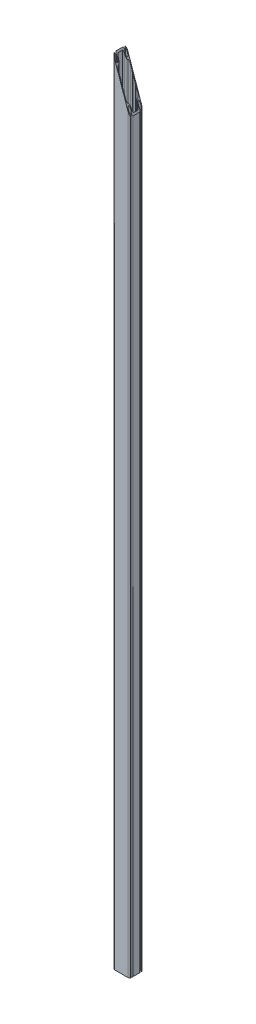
ISO-10303-21;
HEADER;
FILE_DESCRIPTION(('STEP AP214'),'2;1');
FILE_NAME('part.step','',(''),(''),'','','');
FILE_SCHEMA(('AUTOMOTIVE_DESIGN { 1 0 10303 214 1 1 1 1 }'));
ENDSEC;
DATA;
#1=APPLICATION_CONTEXT('core data for automotive mechanical design processes');
#2=APPLICATION_PROTOCOL_DEFINITION('international standard','automotive_design',2000,#1);
#3=PRODUCT_CONTEXT('',#1,'mechanical');
#4=PRODUCT('Part','Part','',(#3));
#5=PRODUCT_RELATED_PRODUCT_CATEGORY('part','',(#4));
#6=PRODUCT_DEFINITION_FORMATION('','',#4);
#7=PRODUCT_DEFINITION_CONTEXT('part definition',#1,'design');
#8=PRODUCT_DEFINITION('design','',#6,#7);
#9=PRODUCT_DEFINITION_SHAPE('','',#8);
#10=(LENGTH_UNIT() NAMED_UNIT(*) SI_UNIT(.MILLI.,.METRE.));
#11=(NAMED_UNIT(*) PLANE_ANGLE_UNIT() SI_UNIT($,.RADIAN.));
#12=(NAMED_UNIT(*) SI_UNIT($,.STERADIAN.) SOLID_ANGLE_UNIT());
#13=UNCERTAINTY_MEASURE_WITH_UNIT(LENGTH_MEASURE(1.E-05),#10,'distance_accuracy_value','');
#14=(GEOMETRIC_REPRESENTATION_CONTEXT(3) GLOBAL_UNCERTAINTY_ASSIGNED_CONTEXT((#13)) GLOBAL_UNIT_ASSIGNED_CONTEXT((#10,
#11,#12)) REPRESENTATION_CONTEXT('',''));
#15=CARTESIAN_POINT('',(0.,0.,0.));
#16=DIRECTION('',(0.,0.,1.));
#17=DIRECTION('',(1.,0.,0.));
#18=AXIS2_PLACEMENT_3D('',#15,#16,#17);
#19=CARTESIAN_POINT('',(-39.5,4753.,-17.8456725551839));
#20=DIRECTION('',(0.,-1.,0.));
#21=DIRECTION('',(0.,0.,-1.));
#22=AXIS2_PLACEMENT_3D('',#19,#20,#21);
#23=CYLINDRICAL_SURFACE('',#22,10.5);
#24=CARTESIAN_POINT('',(-39.5,4722.71200592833,-17.8456725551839));
#25=DIRECTION('',(-0.944834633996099,-0.327547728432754,0.));
#26=DIRECTION('',(0.327547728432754,-0.944834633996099,0.));
#27=AXIS2_PLACEMENT_3D('',#24,#25,#26);
#28=ELLIPSE('',#27,32.0563969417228,10.5);
#29=CARTESIAN_POINT('',(-39.5,4722.71200592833,-7.34567255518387));
#30=VERTEX_POINT('',#29);
#31=CARTESIAN_POINT('',(-29.,4692.42401185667,-17.8456725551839));
#32=VERTEX_POINT('',#31);
#33=EDGE_CURVE('E751',#30,#32,#28,.F.);
#34=ORIENTED_EDGE('',*,*,#33,.F.);
#35=DIRECTION('',(0.,-1.,0.));
#36=VECTOR('',#35,1.);
#37=CARTESIAN_POINT('',(-39.5,4753.,-7.34567255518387));
#38=LINE('',#37,#36);
#39=CARTESIAN_POINT('',(-39.5,0.,-7.34567255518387));
#40=VERTEX_POINT('',#39);
#41=EDGE_CURVE('E240',#30,#40,#38,.T.);
#42=ORIENTED_EDGE('',*,*,#41,.T.);
#43=CARTESIAN_POINT('',(-39.5,0.,-17.8456725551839));
#44=DIRECTION('',(0.,1.,0.));
#45=DIRECTION('',(0.,0.,1.));
#46=AXIS2_PLACEMENT_3D('',#43,#44,#45);
#47=CIRCLE('',#46,10.5);
#48=CARTESIAN_POINT('',(-29.,0.,-17.8456725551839));
#49=VERTEX_POINT('',#48);
#50=EDGE_CURVE('E250',#49,#40,#47,.F.);
#51=ORIENTED_EDGE('',*,*,#50,.F.);
#52=DIRECTION('',(0.,-1.,0.));
#53=VECTOR('',#52,1.);
#54=CARTESIAN_POINT('',(-29.,4753.,-17.8456725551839));
#55=LINE('',#54,#53);
#56=EDGE_CURVE('E11',#32,#49,#55,.T.);
#57=ORIENTED_EDGE('',*,*,#56,.F.);
#58=EDGE_LOOP('',(#34,#42,#51,#57));
#59=FACE_BOUND('',#58,.T.);
#60=ADVANCED_FACE('F41',(#59),#23,.T.);
#61=CARTESIAN_POINT('',(-22.5,4753.,-17.8456725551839));
#62=DIRECTION('',(0.,-1.,0.));
#63=DIRECTION('',(0.,0.,-1.));
#64=AXIS2_PLACEMENT_3D('',#61,#62,#63);
#65=CYLINDRICAL_SURFACE('',#64,6.49999999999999);
#66=DIRECTION('',(0.,-1.,0.));
#67=VECTOR('',#66,1.);
#68=CARTESIAN_POINT('',(-22.5,4753.,-24.3456725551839));
#69=LINE('',#68,#67);
#70=CARTESIAN_POINT('',(-22.5,4673.67430124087,-24.3456725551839));
#71=VERTEX_POINT('',#70);
#72=CARTESIAN_POINT('',(-22.5,0.,-24.3456725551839));
#73=VERTEX_POINT('',#72);
#74=EDGE_CURVE('E51',#71,#73,#69,.T.);
#75=ORIENTED_EDGE('',*,*,#74,.F.);
#76=CARTESIAN_POINT('',(-22.5,4673.67430124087,-17.8456725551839));
#77=DIRECTION('',(-0.944834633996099,-0.327547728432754,0.));
#78=DIRECTION('',(0.327547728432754,-0.944834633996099,0.));
#79=AXIS2_PLACEMENT_3D('',#76,#77,#78);
#80=ELLIPSE('',#79,19.8444362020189,6.49999999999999);
#81=EDGE_CURVE('E747',#71,#32,#80,.F.);
#82=ORIENTED_EDGE('',*,*,#81,.T.);
#83=ORIENTED_EDGE('',*,*,#56,.T.);
#84=CARTESIAN_POINT('',(-22.5,0.,-17.8456725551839));
#85=DIRECTION('',(0.,1.,0.));
#86=DIRECTION('',(0.,0.,1.));
#87=AXIS2_PLACEMENT_3D('',#84,#85,#86);
#88=CIRCLE('',#87,6.49999999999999);
#89=EDGE_CURVE('E509',#49,#73,#88,.F.);
#90=ORIENTED_EDGE('',*,*,#89,.T.);
#91=EDGE_LOOP('',(#75,#82,#83,#90));
#92=FACE_BOUND('',#91,.T.);
#93=ADVANCED_FACE('F1009',(#92),#65,.F.);
#94=CARTESIAN_POINT('',(0.,4753.,-24.3456725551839));
#95=DIRECTION('',(0.,0.,-1.));
#96=DIRECTION('',(-1.,0.,0.));
#97=AXIS2_PLACEMENT_3D('',#94,#95,#96);
#98=PLANE('',#97);
#99=DIRECTION('',(0.,-1.,0.));
#100=VECTOR('',#99,1.);
#101=CARTESIAN_POINT('',(-12.5,4753.,-24.3456725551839));
#102=LINE('',#101,#100);
#103=CARTESIAN_POINT('',(-12.5,4644.82859260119,-24.3456725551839));
#104=VERTEX_POINT('',#103);
#105=CARTESIAN_POINT('',(-12.5,0.,-24.3456725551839));
#106=VERTEX_POINT('',#105);
#107=EDGE_CURVE('E346',#104,#106,#102,.T.);
#108=ORIENTED_EDGE('',*,*,#107,.F.);
#109=DIRECTION('',(-0.327547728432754,0.944834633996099,0.));
#110=VECTOR('',#109,1.);
#111=CARTESIAN_POINT('',(-44.6356242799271,4737.5260780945,-24.3456725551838));
#112=LINE('',#111,#110);
#113=EDGE_CURVE('E743',#104,#71,#112,.T.);
#114=ORIENTED_EDGE('',*,*,#113,.T.);
#115=ORIENTED_EDGE('',*,*,#74,.T.);
#116=DIRECTION('',(1.,0.,0.));
#117=VECTOR('',#116,1.);
#118=CARTESIAN_POINT('',(0.,0.,-24.3456725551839));
#119=LINE('',#118,#117);
#120=EDGE_CURVE('E513',#73,#106,#119,.T.);
#121=ORIENTED_EDGE('',*,*,#120,.T.);
#122=EDGE_LOOP('',(#108,#114,#115,#121));
#123=FACE_BOUND('',#122,.T.);
#124=ADVANCED_FACE('F1007',(#123),#98,.F.);
#125=CARTESIAN_POINT('',(5.92283627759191,4753.,-5.9228362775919));
#126=DIRECTION('',(-0.707106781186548,0.,0.707106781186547));
#127=DIRECTION('',(0.707106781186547,0.,0.707106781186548));
#128=AXIS2_PLACEMENT_3D('',#125,#126,#127);
#129=PLANE('',#128);
#130=DIRECTION('',(0.311275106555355,-0.897895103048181,0.311275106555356));
#131=VECTOR('',#130,1.);
#132=CARTESIAN_POINT('',(-39.1630276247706,4721.73998523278,-51.0087001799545));
#133=LINE('',#132,#131);
#134=CARTESIAN_POINT('',(-11.,4640.50173630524,-22.8456725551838));
#135=VERTEX_POINT('',#134);
#136=EDGE_CURVE('E739',#104,#135,#133,.T.);
#137=ORIENTED_EDGE('',*,*,#136,.F.);
#138=ORIENTED_EDGE('',*,*,#107,.T.);
#139=DIRECTION('',(-0.707106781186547,0.,-0.707106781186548));
#140=VECTOR('',#139,1.);
#141=CARTESIAN_POINT('',(5.92283627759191,0.,-5.9228362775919));
#142=LINE('',#141,#140);
#143=CARTESIAN_POINT('',(-11.,0.,-22.8456725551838));
#144=VERTEX_POINT('',#143);
#145=EDGE_CURVE('E517',#144,#106,#142,.T.);
#146=ORIENTED_EDGE('',*,*,#145,.F.);
#147=DIRECTION('',(0.,-1.,0.));
#148=VECTOR('',#147,1.);
#149=CARTESIAN_POINT('',(-11.,4753.,-22.8456725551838));
#150=LINE('',#149,#148);
#151=EDGE_CURVE('E343',#135,#144,#150,.T.);
#152=ORIENTED_EDGE('',*,*,#151,.F.);
#153=EDGE_LOOP('',(#137,#138,#146,#152));
#154=FACE_BOUND('',#153,.T.);
#155=ADVANCED_FACE('F1175',(#154),#129,.T.);
#156=CARTESIAN_POINT('',(0.,4753.,-22.8456725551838));
#157=DIRECTION('',(0.,0.,-1.));
#158=DIRECTION('',(-1.,0.,0.));
#159=AXIS2_PLACEMENT_3D('',#156,#157,#158);
#160=PLANE('',#159);
#161=DIRECTION('',(0.,-1.,0.));
#162=VECTOR('',#161,1.);
#163=CARTESIAN_POINT('',(-8.,4753.,-22.8456725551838));
#164=LINE('',#163,#162);
#165=CARTESIAN_POINT('',(-7.99999999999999,4631.84802371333,-22.8456725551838));
#166=VERTEX_POINT('',#165);
#167=CARTESIAN_POINT('',(-8.,0.,-22.8456725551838));
#168=VERTEX_POINT('',#167);
#169=EDGE_CURVE('E340',#166,#168,#164,.T.);
#170=ORIENTED_EDGE('',*,*,#169,.F.);
#171=DIRECTION('',(-0.327547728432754,0.944834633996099,0.));
#172=VECTOR('',#171,1.);
#173=CARTESIAN_POINT('',(-44.6356242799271,4737.5260780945,-22.8456725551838));
#174=LINE('',#173,#172);
#175=EDGE_CURVE('E735',#166,#135,#174,.T.);
#176=ORIENTED_EDGE('',*,*,#175,.T.);
#177=ORIENTED_EDGE('',*,*,#151,.T.);
#178=DIRECTION('',(1.,0.,0.));
#179=VECTOR('',#178,1.);
#180=CARTESIAN_POINT('',(0.,0.,-22.8456725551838));
#181=LINE('',#180,#179);
#182=EDGE_CURVE('E521',#144,#168,#181,.T.);
#183=ORIENTED_EDGE('',*,*,#182,.T.);
#184=EDGE_LOOP('',(#170,#176,#177,#183));
#185=FACE_BOUND('',#184,.T.);
#186=ADVANCED_FACE('F1171',(#185),#160,.F.);
#187=CARTESIAN_POINT('',(-15.4228362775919,4753.,-15.422836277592));
#188=DIRECTION('',(-0.707106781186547,0.,-0.707106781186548));
#189=DIRECTION('',(-0.707106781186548,0.,0.707106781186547));
#190=AXIS2_PLACEMENT_3D('',#187,#188,#189);
#191=PLANE('',#190);
#192=DIRECTION('',(0.,-1.,0.));
#193=VECTOR('',#192,1.);
#194=CARTESIAN_POINT('',(-6.50000000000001,4753.,-24.3456725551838));
#195=LINE('',#194,#193);
#196=CARTESIAN_POINT('',(-6.50000000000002,4627.52116741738,-24.3456725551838));
#197=VERTEX_POINT('',#196);
#198=CARTESIAN_POINT('',(-6.50000000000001,0.,-24.3456725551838));
#199=VERTEX_POINT('',#198);
#200=EDGE_CURVE('E337',#197,#199,#195,.T.);
#201=ORIENTED_EDGE('',*,*,#200,.F.);
#202=DIRECTION('',(-0.311275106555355,0.897895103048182,0.311275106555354));
#203=VECTOR('',#202,1.);
#204=CARTESIAN_POINT('',(-43.2994856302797,4733.6718914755,12.4538130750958));
#205=LINE('',#204,#203);
#206=EDGE_CURVE('E731',#197,#166,#205,.T.);
#207=ORIENTED_EDGE('',*,*,#206,.T.);
#208=ORIENTED_EDGE('',*,*,#169,.T.);
#209=DIRECTION('',(0.707106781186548,0.,-0.707106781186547));
#210=VECTOR('',#209,1.);
#211=CARTESIAN_POINT('',(-15.4228362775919,0.,-15.422836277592));
#212=LINE('',#211,#210);
#213=EDGE_CURVE('E525',#168,#199,#212,.T.);
#214=ORIENTED_EDGE('',*,*,#213,.T.);
#215=EDGE_LOOP('',(#201,#207,#208,#214));
#216=FACE_BOUND('',#215,.T.);
#217=ADVANCED_FACE('F1167',(#216),#191,.F.);
#218=CARTESIAN_POINT('',(0.,4753.,-24.3456725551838));
#219=DIRECTION('',(0.,0.,1.));
#220=DIRECTION('',(1.,0.,0.));
#221=AXIS2_PLACEMENT_3D('',#218,#219,#220);
#222=PLANE('',#221);
#223=DIRECTION('',(0.327547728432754,-0.944834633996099,0.));
#224=VECTOR('',#223,1.);
#225=CARTESIAN_POINT('',(-44.6356242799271,4737.5260780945,-24.3456725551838));
#226=LINE('',#225,#224);
#227=CARTESIAN_POINT('',(6.50000000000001,4590.02174618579,-24.3456725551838));
#228=VERTEX_POINT('',#227);
#229=EDGE_CURVE('E727',#197,#228,#226,.T.);
#230=ORIENTED_EDGE('',*,*,#229,.F.);
#231=ORIENTED_EDGE('',*,*,#200,.T.);
#232=DIRECTION('',(-1.,0.,0.));
#233=VECTOR('',#232,1.);
#234=CARTESIAN_POINT('',(0.,0.,-24.3456725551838));
#235=LINE('',#234,#233);
#236=CARTESIAN_POINT('',(6.50000000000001,0.,-24.3456725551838));
#237=VERTEX_POINT('',#236);
#238=EDGE_CURVE('E529',#237,#199,#235,.T.);
#239=ORIENTED_EDGE('',*,*,#238,.F.);
#240=DIRECTION('',(0.,-1.,0.));
#241=VECTOR('',#240,1.);
#242=CARTESIAN_POINT('',(6.50000000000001,4753.,-24.3456725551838));
#243=LINE('',#242,#241);
#244=EDGE_CURVE('E334',#228,#237,#243,.T.);
#245=ORIENTED_EDGE('',*,*,#244,.F.);
#246=EDGE_LOOP('',(#230,#231,#239,#245));
#247=FACE_BOUND('',#246,.T.);
#248=ADVANCED_FACE('F1163',(#247),#222,.T.);
#249=CARTESIAN_POINT('',(15.4228362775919,4753.,-15.422836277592));
#250=DIRECTION('',(-0.707106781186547,0.,0.707106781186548));
#251=DIRECTION('',(0.707106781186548,0.,0.707106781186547));
#252=AXIS2_PLACEMENT_3D('',#249,#250,#251);
#253=PLANE('',#252);
#254=DIRECTION('',(0.311275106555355,-0.897895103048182,0.311275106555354));
#255=VECTOR('',#254,1.);
#256=CARTESIAN_POINT('',(-37.3220759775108,4716.42962974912,-68.1677485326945));
#257=LINE('',#256,#255);
#258=CARTESIAN_POINT('',(8.00000000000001,4585.69488988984,-22.8456725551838));
#259=VERTEX_POINT('',#258);
#260=EDGE_CURVE('E723',#228,#259,#257,.T.);
#261=ORIENTED_EDGE('',*,*,#260,.F.);
#262=ORIENTED_EDGE('',*,*,#244,.T.);
#263=DIRECTION('',(-0.707106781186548,0.,-0.707106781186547));
#264=VECTOR('',#263,1.);
#265=CARTESIAN_POINT('',(15.4228362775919,0.,-15.422836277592));
#266=LINE('',#265,#264);
#267=CARTESIAN_POINT('',(8.,0.,-22.8456725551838));
#268=VERTEX_POINT('',#267);
#269=EDGE_CURVE('E533',#268,#237,#266,.T.);
#270=ORIENTED_EDGE('',*,*,#269,.F.);
#271=DIRECTION('',(0.,-1.,0.));
#272=VECTOR('',#271,1.);
#273=CARTESIAN_POINT('',(8.,4753.,-22.8456725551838));
#274=LINE('',#273,#272);
#275=EDGE_CURVE('E331',#259,#268,#274,.T.);
#276=ORIENTED_EDGE('',*,*,#275,.F.);
#277=EDGE_LOOP('',(#261,#262,#270,#276));
#278=FACE_BOUND('',#277,.T.);
#279=ADVANCED_FACE('F1159',(#278),#253,.T.);
#280=CARTESIAN_POINT('',(0.,4753.,-22.8456725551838));
#281=DIRECTION('',(0.,0.,1.));
#282=DIRECTION('',(1.,0.,0.));
#283=AXIS2_PLACEMENT_3D('',#280,#281,#282);
#284=PLANE('',#283);
#285=DIRECTION('',(0.327547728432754,-0.944834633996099,0.));
#286=VECTOR('',#285,1.);
#287=CARTESIAN_POINT('',(-44.6356242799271,4737.5260780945,-22.8456725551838));
#288=LINE('',#287,#286);
#289=CARTESIAN_POINT('',(11.,4577.04117729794,-22.8456725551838));
#290=VERTEX_POINT('',#289);
#291=EDGE_CURVE('E719',#259,#290,#288,.T.);
#292=ORIENTED_EDGE('',*,*,#291,.F.);
#293=ORIENTED_EDGE('',*,*,#275,.T.);
#294=DIRECTION('',(-1.,0.,0.));
#295=VECTOR('',#294,1.);
#296=CARTESIAN_POINT('',(0.,0.,-22.8456725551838));
#297=LINE('',#296,#295);
#298=CARTESIAN_POINT('',(11.,0.,-22.8456725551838));
#299=VERTEX_POINT('',#298);
#300=EDGE_CURVE('E537',#299,#268,#297,.T.);
#301=ORIENTED_EDGE('',*,*,#300,.F.);
#302=DIRECTION('',(0.,-1.,0.));
#303=VECTOR('',#302,1.);
#304=CARTESIAN_POINT('',(11.,4753.,-22.8456725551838));
#305=LINE('',#304,#303);
#306=EDGE_CURVE('E328',#290,#299,#305,.T.);
#307=ORIENTED_EDGE('',*,*,#306,.F.);
#308=EDGE_LOOP('',(#292,#293,#301,#307));
#309=FACE_BOUND('',#308,.T.);
#310=ADVANCED_FACE('F1155',(#309),#284,.T.);
#311=CARTESIAN_POINT('',(-5.92283627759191,4753.,-5.9228362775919));
#312=DIRECTION('',(-0.707106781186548,0.,-0.707106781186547));
#313=DIRECTION('',(-0.707106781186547,0.,0.707106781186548));
#314=AXIS2_PLACEMENT_3D('',#311,#312,#313);
#315=PLANE('',#314);
#316=DIRECTION('',(0.,-1.,0.));
#317=VECTOR('',#316,1.);
#318=CARTESIAN_POINT('',(12.5,4753.,-24.3456725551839));
#319=LINE('',#318,#317);
#320=CARTESIAN_POINT('',(12.5,4572.71432100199,-24.3456725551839));
#321=VERTEX_POINT('',#320);
#322=CARTESIAN_POINT('',(12.5,0.,-24.3456725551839));
#323=VERTEX_POINT('',#322);
#324=EDGE_CURVE('E325',#321,#323,#319,.T.);
#325=ORIENTED_EDGE('',*,*,#324,.F.);
#326=DIRECTION('',(-0.311275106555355,0.897895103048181,0.311275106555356));
#327=VECTOR('',#326,1.);
#328=CARTESIAN_POINT('',(-41.4585339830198,4728.36153599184,29.6128614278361));
#329=LINE('',#328,#327);
#330=EDGE_CURVE('E715',#321,#290,#329,.T.);
#331=ORIENTED_EDGE('',*,*,#330,.T.);
#332=ORIENTED_EDGE('',*,*,#306,.T.);
#333=DIRECTION('',(0.707106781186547,0.,-0.707106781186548));
#334=VECTOR('',#333,1.);
#335=CARTESIAN_POINT('',(-5.92283627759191,0.,-5.9228362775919));
#336=LINE('',#335,#334);
#337=EDGE_CURVE('E541',#299,#323,#336,.T.);
#338=ORIENTED_EDGE('',*,*,#337,.T.);
#339=EDGE_LOOP('',(#325,#331,#332,#338));
#340=FACE_BOUND('',#339,.T.);
#341=ADVANCED_FACE('F1151',(#340),#315,.F.);
#342=CARTESIAN_POINT('',(0.,4753.,-24.3456725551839));
#343=DIRECTION('',(0.,0.,1.));
#344=DIRECTION('',(1.,0.,0.));
#345=AXIS2_PLACEMENT_3D('',#342,#343,#344);
#346=PLANE('',#345);
#347=DIRECTION('',(0.327547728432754,-0.944834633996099,0.));
#348=VECTOR('',#347,1.);
#349=CARTESIAN_POINT('',(-44.6356242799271,4737.5260780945,-24.3456725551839));
#350=LINE('',#349,#348);
#351=CARTESIAN_POINT('',(22.5,4543.8686123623,-24.3456725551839));
#352=VERTEX_POINT('',#351);
#353=EDGE_CURVE('E711',#321,#352,#350,.T.);
#354=ORIENTED_EDGE('',*,*,#353,.F.);
#355=ORIENTED_EDGE('',*,*,#324,.T.);
#356=DIRECTION('',(-1.,0.,0.));
#357=VECTOR('',#356,1.);
#358=CARTESIAN_POINT('',(0.,0.,-24.3456725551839));
#359=LINE('',#358,#357);
#360=CARTESIAN_POINT('',(22.5,0.,-24.3456725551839));
#361=VERTEX_POINT('',#360);
#362=EDGE_CURVE('E545',#361,#323,#359,.T.);
#363=ORIENTED_EDGE('',*,*,#362,.F.);
#364=DIRECTION('',(0.,-1.,0.));
#365=VECTOR('',#364,1.);
#366=CARTESIAN_POINT('',(22.5,4753.,-24.3456725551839));
#367=LINE('',#366,#365);
#368=EDGE_CURVE('E322',#352,#361,#367,.T.);
#369=ORIENTED_EDGE('',*,*,#368,.F.);
#370=EDGE_LOOP('',(#354,#355,#363,#369));
#371=FACE_BOUND('',#370,.T.);
#372=ADVANCED_FACE('F1147',(#371),#346,.T.);
#373=CARTESIAN_POINT('',(22.5,4753.,-17.8456725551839));
#374=DIRECTION('',(0.,-1.,0.));
#375=DIRECTION('',(0.,0.,-1.));
#376=AXIS2_PLACEMENT_3D('',#373,#374,#375);
#377=CYLINDRICAL_SURFACE('',#376,6.49999999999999);
#378=CARTESIAN_POINT('',(22.5,4543.8686123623,-17.8456725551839));
#379=DIRECTION('',(-0.944834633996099,-0.327547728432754,0.));
#380=DIRECTION('',(0.327547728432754,-0.944834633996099,0.));
#381=AXIS2_PLACEMENT_3D('',#378,#379,#380);
#382=ELLIPSE('',#381,19.8444362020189,6.49999999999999);
#383=CARTESIAN_POINT('',(29.,4525.11890174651,-17.8456725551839));
#384=VERTEX_POINT('',#383);
#385=EDGE_CURVE('E707',#352,#384,#382,.T.);
#386=ORIENTED_EDGE('',*,*,#385,.F.);
#387=ORIENTED_EDGE('',*,*,#368,.T.);
#388=CARTESIAN_POINT('',(22.5,0.,-17.8456725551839));
#389=DIRECTION('',(0.,1.,0.));
#390=DIRECTION('',(0.,0.,1.));
#391=AXIS2_PLACEMENT_3D('',#388,#389,#390);
#392=CIRCLE('',#391,6.49999999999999);
#393=CARTESIAN_POINT('',(29.,0.,-17.8456725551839));
#394=VERTEX_POINT('',#393);
#395=EDGE_CURVE('E549',#394,#361,#392,.T.);
#396=ORIENTED_EDGE('',*,*,#395,.F.);
#397=DIRECTION('',(0.,-1.,0.));
#398=VECTOR('',#397,1.);
#399=CARTESIAN_POINT('',(29.,4753.,-17.8456725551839));
#400=LINE('',#399,#398);
#401=EDGE_CURVE('E319',#384,#394,#400,.T.);
#402=ORIENTED_EDGE('',*,*,#401,.F.);
#403=EDGE_LOOP('',(#386,#387,#396,#402));
#404=FACE_BOUND('',#403,.T.);
#405=ADVANCED_FACE('F1143',(#404),#377,.F.);
#406=CARTESIAN_POINT('',(39.5,4753.,-17.8456725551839));
#407=DIRECTION('',(0.,-1.,0.));
#408=DIRECTION('',(0.,0.,-1.));
#409=AXIS2_PLACEMENT_3D('',#406,#407,#408);
#410=CYLINDRICAL_SURFACE('',#409,10.5);
#411=DIRECTION('',(0.,-1.,0.));
#412=VECTOR('',#411,1.);
#413=CARTESIAN_POINT('',(39.5,4753.,-7.34567255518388));
#414=LINE('',#413,#412);
#415=CARTESIAN_POINT('',(39.5,4494.83090767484,-7.34567255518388));
#416=VERTEX_POINT('',#415);
#417=CARTESIAN_POINT('',(39.5,0.,-7.34567255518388));
#418=VERTEX_POINT('',#417);
#419=EDGE_CURVE('E316',#416,#418,#414,.T.);
#420=ORIENTED_EDGE('',*,*,#419,.F.);
#421=CARTESIAN_POINT('',(39.5,4494.83090767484,-17.8456725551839));
#422=DIRECTION('',(-0.944834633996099,-0.327547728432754,0.));
#423=DIRECTION('',(0.327547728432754,-0.944834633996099,0.));
#424=AXIS2_PLACEMENT_3D('',#421,#422,#423);
#425=ELLIPSE('',#424,32.0563969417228,10.5);
#426=EDGE_CURVE('E703',#416,#384,#425,.T.);
#427=ORIENTED_EDGE('',*,*,#426,.T.);
#428=ORIENTED_EDGE('',*,*,#401,.T.);
#429=CARTESIAN_POINT('',(39.5,0.,-17.8456725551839));
#430=DIRECTION('',(0.,1.,0.));
#431=DIRECTION('',(0.,0.,1.));
#432=AXIS2_PLACEMENT_3D('',#429,#430,#431);
#433=CIRCLE('',#432,10.5);
#434=EDGE_CURVE('E553',#394,#418,#433,.T.);
#435=ORIENTED_EDGE('',*,*,#434,.T.);
#436=EDGE_LOOP('',(#420,#427,#428,#435));
#437=FACE_BOUND('',#436,.T.);
#438=ADVANCED_FACE('F1139',(#437),#410,.T.);
#439=CARTESIAN_POINT('',(39.5,4753.,-0.845672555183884));
#440=DIRECTION('',(0.,-1.,0.));
#441=DIRECTION('',(0.,0.,-1.));
#442=AXIS2_PLACEMENT_3D('',#439,#440,#441);
#443=CYLINDRICAL_SURFACE('',#442,6.49999999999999);
#444=CARTESIAN_POINT('',(39.5,4494.83090767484,-0.845672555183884));
#445=DIRECTION('',(-0.944834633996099,-0.327547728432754,0.));
#446=DIRECTION('',(0.327547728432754,-0.944834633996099,0.));
#447=AXIS2_PLACEMENT_3D('',#444,#445,#446);
#448=ELLIPSE('',#447,19.8444362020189,6.49999999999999);
#449=CARTESIAN_POINT('',(46.,4476.08119705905,-0.845672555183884));
#450=VERTEX_POINT('',#449);
#451=EDGE_CURVE('E699',#416,#450,#448,.T.);
#452=ORIENTED_EDGE('',*,*,#451,.F.);
#453=ORIENTED_EDGE('',*,*,#419,.T.);
#454=CARTESIAN_POINT('',(39.5,0.,-0.845672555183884));
#455=DIRECTION('',(0.,1.,0.));
#456=DIRECTION('',(0.,0.,1.));
#457=AXIS2_PLACEMENT_3D('',#454,#455,#456);
#458=CIRCLE('',#457,6.49999999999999);
#459=CARTESIAN_POINT('',(46.,0.,-0.845672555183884));
#460=VERTEX_POINT('',#459);
#461=EDGE_CURVE('E557',#460,#418,#458,.T.);
#462=ORIENTED_EDGE('',*,*,#461,.F.);
#463=DIRECTION('',(0.,-1.,0.));
#464=VECTOR('',#463,1.);
#465=CARTESIAN_POINT('',(46.,4753.,-0.845672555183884));
#466=LINE('',#465,#464);
#467=EDGE_CURVE('E313',#450,#460,#466,.T.);
#468=ORIENTED_EDGE('',*,*,#467,.F.);
#469=EDGE_LOOP('',(#452,#453,#462,#468));
#470=FACE_BOUND('',#469,.T.);
#471=ADVANCED_FACE('F1135',(#470),#443,.F.);
#472=CARTESIAN_POINT('',(46.,4753.,0.));
#473=DIRECTION('',(-1.,0.,0.));
#474=DIRECTION('',(0.,0.,1.));
#475=AXIS2_PLACEMENT_3D('',#472,#473,#474);
#476=PLANE('',#475);
#477=DIRECTION('',(0.,0.,1.));
#478=VECTOR('',#477,1.);
#479=CARTESIAN_POINT('',(46.,4476.08119705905,0.));
#480=LINE('',#479,#478);
#481=CARTESIAN_POINT('',(46.,4476.08119705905,24.1543274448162));
#482=VERTEX_POINT('',#481);
#483=EDGE_CURVE('E695',#450,#482,#480,.T.);
#484=ORIENTED_EDGE('',*,*,#483,.F.);
#485=ORIENTED_EDGE('',*,*,#467,.T.);
#486=DIRECTION('',(0.,0.,-1.));
#487=VECTOR('',#486,1.);
#488=CARTESIAN_POINT('',(46.,0.,0.));
#489=LINE('',#488,#487);
#490=CARTESIAN_POINT('',(46.,0.,24.1543274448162));
#491=VERTEX_POINT('',#490);
#492=EDGE_CURVE('E561',#491,#460,#489,.T.);
#493=ORIENTED_EDGE('',*,*,#492,.F.);
#494=DIRECTION('',(0.,-1.,0.));
#495=VECTOR('',#494,1.);
#496=CARTESIAN_POINT('',(46.,4753.,24.1543274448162));
#497=LINE('',#496,#495);
#498=EDGE_CURVE('E310',#482,#491,#497,.T.);
#499=ORIENTED_EDGE('',*,*,#498,.F.);
#500=EDGE_LOOP('',(#484,#485,#493,#499));
#501=FACE_BOUND('',#500,.T.);
#502=ADVANCED_FACE('F1131',(#501),#476,.T.);
#503=CARTESIAN_POINT('',(39.5,4753.,24.1543274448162));
#504=DIRECTION('',(0.,-1.,0.));
#505=DIRECTION('',(0.,0.,-1.));
#506=AXIS2_PLACEMENT_3D('',#503,#504,#505);
#507=CYLINDRICAL_SURFACE('',#506,6.49999999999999);
#508=DIRECTION('',(0.,-1.,0.));
#509=VECTOR('',#508,1.);
#510=CARTESIAN_POINT('',(39.5,4753.,30.6543274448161));
#511=LINE('',#510,#509);
#512=CARTESIAN_POINT('',(39.5,4494.83090767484,30.6543274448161));
#513=VERTEX_POINT('',#512);
#514=CARTESIAN_POINT('',(39.5,0.,30.6543274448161));
#515=VERTEX_POINT('',#514);
#516=EDGE_CURVE('E307',#513,#515,#511,.T.);
#517=ORIENTED_EDGE('',*,*,#516,.F.);
#518=CARTESIAN_POINT('',(39.5,4494.83090767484,24.1543274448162));
#519=DIRECTION('',(-0.944834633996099,-0.327547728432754,0.));
#520=DIRECTION('',(0.327547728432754,-0.944834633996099,0.));
#521=AXIS2_PLACEMENT_3D('',#518,#519,#520);
#522=ELLIPSE('',#521,19.8444362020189,6.49999999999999);
#523=EDGE_CURVE('E691',#513,#482,#522,.F.);
#524=ORIENTED_EDGE('',*,*,#523,.T.);
#525=ORIENTED_EDGE('',*,*,#498,.T.);
#526=CARTESIAN_POINT('',(39.5,0.,24.1543274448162));
#527=DIRECTION('',(0.,1.,0.));
#528=DIRECTION('',(0.,0.,1.));
#529=AXIS2_PLACEMENT_3D('',#526,#527,#528);
#530=CIRCLE('',#529,6.49999999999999);
#531=EDGE_CURVE('E565',#491,#515,#530,.F.);
#532=ORIENTED_EDGE('',*,*,#531,.T.);
#533=EDGE_LOOP('',(#517,#524,#525,#532));
#534=FACE_BOUND('',#533,.T.);
#535=ADVANCED_FACE('F1127',(#534),#507,.F.);
#536=CARTESIAN_POINT('',(39.5,4753.,41.1543274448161));
#537=DIRECTION('',(0.,-1.,0.));
#538=DIRECTION('',(0.,0.,-1.));
#539=AXIS2_PLACEMENT_3D('',#536,#537,#538);
#540=CYLINDRICAL_SURFACE('',#539,10.5);
#541=CARTESIAN_POINT('',(39.5,4494.83090767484,41.1543274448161));
#542=DIRECTION('',(-0.944834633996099,-0.327547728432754,0.));
#543=DIRECTION('',(0.327547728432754,-0.944834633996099,0.));
#544=AXIS2_PLACEMENT_3D('',#541,#542,#543);
#545=ELLIPSE('',#544,32.0563969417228,10.5);
#546=CARTESIAN_POINT('',(29.,4525.11890174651,41.1543274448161));
#547=VERTEX_POINT('',#546);
#548=EDGE_CURVE('E687',#513,#547,#545,.F.);
#549=ORIENTED_EDGE('',*,*,#548,.F.);
#550=ORIENTED_EDGE('',*,*,#516,.T.);
#551=CARTESIAN_POINT('',(39.5,0.,41.1543274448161));
#552=DIRECTION('',(0.,1.,0.));
#553=DIRECTION('',(0.,0.,1.));
#554=AXIS2_PLACEMENT_3D('',#551,#552,#553);
#555=CIRCLE('',#554,10.5);
#556=CARTESIAN_POINT('',(29.,0.,41.1543274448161));
#557=VERTEX_POINT('',#556);
#558=EDGE_CURVE('E569',#557,#515,#555,.F.);
#559=ORIENTED_EDGE('',*,*,#558,.F.);
#560=DIRECTION('',(0.,-1.,0.));
#561=VECTOR('',#560,1.);
#562=CARTESIAN_POINT('',(29.,4753.,41.1543274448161));
#563=LINE('',#562,#561);
#564=EDGE_CURVE('E304',#547,#557,#563,.T.);
#565=ORIENTED_EDGE('',*,*,#564,.F.);
#566=EDGE_LOOP('',(#549,#550,#559,#565));
#567=FACE_BOUND('',#566,.T.);
#568=ADVANCED_FACE('F1123',(#567),#540,.T.);
#569=CARTESIAN_POINT('',(22.5,4753.,41.1543274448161));
#570=DIRECTION('',(0.,-1.,0.));
#571=DIRECTION('',(0.,0.,-1.));
#572=AXIS2_PLACEMENT_3D('',#569,#570,#571);
#573=CYLINDRICAL_SURFACE('',#572,6.5);
#574=DIRECTION('',(0.,-1.,0.));
#575=VECTOR('',#574,1.);
#576=CARTESIAN_POINT('',(22.5,4753.,47.6543274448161));
#577=LINE('',#576,#575);
#578=CARTESIAN_POINT('',(22.5,4543.8686123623,47.6543274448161));
#579=VERTEX_POINT('',#578);
#580=CARTESIAN_POINT('',(22.5,0.,47.6543274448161));
#581=VERTEX_POINT('',#580);
#582=EDGE_CURVE('E301',#579,#581,#577,.T.);
#583=ORIENTED_EDGE('',*,*,#582,.F.);
#584=CARTESIAN_POINT('',(22.5,4543.8686123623,41.1543274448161));
#585=DIRECTION('',(-0.944834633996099,-0.327547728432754,0.));
#586=DIRECTION('',(0.327547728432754,-0.944834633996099,0.));
#587=AXIS2_PLACEMENT_3D('',#584,#585,#586);
#588=ELLIPSE('',#587,19.8444362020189,6.5);
#589=EDGE_CURVE('E683',#579,#547,#588,.F.);
#590=ORIENTED_EDGE('',*,*,#589,.T.);
#591=ORIENTED_EDGE('',*,*,#564,.T.);
#592=CARTESIAN_POINT('',(22.5,0.,41.1543274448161));
#593=DIRECTION('',(0.,1.,0.));
#594=DIRECTION('',(0.,0.,1.));
#595=AXIS2_PLACEMENT_3D('',#592,#593,#594);
#596=CIRCLE('',#595,6.5);
#597=EDGE_CURVE('E573',#557,#581,#596,.F.);
#598=ORIENTED_EDGE('',*,*,#597,.T.);
#599=EDGE_LOOP('',(#583,#590,#591,#598));
#600=FACE_BOUND('',#599,.T.);
#601=ADVANCED_FACE('F1119',(#600),#573,.F.);
#602=CARTESIAN_POINT('',(0.,4753.,47.6543274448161));
#603=DIRECTION('',(0.,0.,-1.));
#604=DIRECTION('',(-1.,0.,0.));
#605=AXIS2_PLACEMENT_3D('',#602,#603,#604);
#606=PLANE('',#605);
#607=DIRECTION('',(-0.327547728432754,0.944834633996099,0.));
#608=VECTOR('',#607,1.);
#609=CARTESIAN_POINT('',(-44.6356242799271,4737.5260780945,47.6543274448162));
#610=LINE('',#609,#608);
#611=CARTESIAN_POINT('',(12.5,4572.71432100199,47.6543274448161));
#612=VERTEX_POINT('',#611);
#613=EDGE_CURVE('E679',#579,#612,#610,.T.);
#614=ORIENTED_EDGE('',*,*,#613,.F.);
#615=ORIENTED_EDGE('',*,*,#582,.T.);
#616=DIRECTION('',(1.,0.,0.));
#617=VECTOR('',#616,1.);
#618=CARTESIAN_POINT('',(0.,0.,47.6543274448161));
#619=LINE('',#618,#617);
#620=CARTESIAN_POINT('',(12.5,0.,47.6543274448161));
#621=VERTEX_POINT('',#620);
#622=EDGE_CURVE('E577',#621,#581,#619,.T.);
#623=ORIENTED_EDGE('',*,*,#622,.F.);
#624=DIRECTION('',(0.,-1.,0.));
#625=VECTOR('',#624,1.);
#626=CARTESIAN_POINT('',(12.5,4753.,47.6543274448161));
#627=LINE('',#626,#625);
#628=EDGE_CURVE('E298',#612,#621,#627,.T.);
#629=ORIENTED_EDGE('',*,*,#628,.F.);
#630=EDGE_LOOP('',(#614,#615,#623,#629));
#631=FACE_BOUND('',#630,.T.);
#632=ADVANCED_FACE('F1115',(#631),#606,.T.);
#633=CARTESIAN_POINT('',(-17.577163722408,4753.,17.577163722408));
#634=DIRECTION('',(0.707106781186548,0.,-0.707106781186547));
#635=DIRECTION('',(-0.707106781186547,0.,-0.707106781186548));
#636=AXIS2_PLACEMENT_3D('',#633,#634,#635);
#637=PLANE('',#636);
#638=DIRECTION('',(-0.311275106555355,0.897895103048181,-0.311275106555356));
#639=VECTOR('',#638,1.);
#640=CARTESIAN_POINT('',(-43.7169606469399,4734.876127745,-8.56263320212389));
#641=LINE('',#640,#639);
#642=CARTESIAN_POINT('',(11.,4577.04117729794,46.1543274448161));
#643=VERTEX_POINT('',#642);
#644=EDGE_CURVE('E675',#612,#643,#641,.T.);
#645=ORIENTED_EDGE('',*,*,#644,.F.);
#646=ORIENTED_EDGE('',*,*,#628,.T.);
#647=DIRECTION('',(0.707106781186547,0.,0.707106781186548));
#648=VECTOR('',#647,1.);
#649=CARTESIAN_POINT('',(-17.577163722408,0.,17.577163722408));
#650=LINE('',#649,#648);
#651=CARTESIAN_POINT('',(11.,0.,46.1543274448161));
#652=VERTEX_POINT('',#651);
#653=EDGE_CURVE('E581',#652,#621,#650,.T.);
#654=ORIENTED_EDGE('',*,*,#653,.F.);
#655=DIRECTION('',(0.,-1.,0.));
#656=VECTOR('',#655,1.);
#657=CARTESIAN_POINT('',(11.,4753.,46.1543274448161));
#658=LINE('',#657,#656);
#659=EDGE_CURVE('E295',#643,#652,#658,.T.);
#660=ORIENTED_EDGE('',*,*,#659,.F.);
#661=EDGE_LOOP('',(#645,#646,#654,#660));
#662=FACE_BOUND('',#661,.T.);
#663=ADVANCED_FACE('F1111',(#662),#637,.T.);
#664=CARTESIAN_POINT('',(0.,4753.,46.1543274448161));
#665=DIRECTION('',(0.,0.,1.));
#666=DIRECTION('',(1.,0.,0.));
#667=AXIS2_PLACEMENT_3D('',#664,#665,#666);
#668=PLANE('',#667);
#669=DIRECTION('',(0.,-1.,0.));
#670=VECTOR('',#669,1.);
#671=CARTESIAN_POINT('',(8.,4753.,46.1543274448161));
#672=LINE('',#671,#670);
#673=CARTESIAN_POINT('',(8.,4585.69488988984,46.1543274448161));
#674=VERTEX_POINT('',#673);
#675=CARTESIAN_POINT('',(8.,0.,46.1543274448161));
#676=VERTEX_POINT('',#675);
#677=EDGE_CURVE('E292',#674,#676,#672,.T.);
#678=ORIENTED_EDGE('',*,*,#677,.F.);
#679=DIRECTION('',(0.327547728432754,-0.944834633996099,0.));
#680=VECTOR('',#679,1.);
#681=CARTESIAN_POINT('',(-44.6356242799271,4737.5260780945,46.1543274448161));
#682=LINE('',#681,#680);
#683=EDGE_CURVE('E671',#674,#643,#682,.T.);
#684=ORIENTED_EDGE('',*,*,#683,.T.);
#685=ORIENTED_EDGE('',*,*,#659,.T.);
#686=DIRECTION('',(-1.,0.,0.));
#687=VECTOR('',#686,1.);
#688=CARTESIAN_POINT('',(0.,0.,46.1543274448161));
#689=LINE('',#688,#687);
#690=EDGE_CURVE('E585',#652,#676,#689,.T.);
#691=ORIENTED_EDGE('',*,*,#690,.T.);
#692=EDGE_LOOP('',(#678,#684,#685,#691));
#693=FACE_BOUND('',#692,.T.);
#694=ADVANCED_FACE('F1107',(#693),#668,.F.);
#695=CARTESIAN_POINT('',(27.077163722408,4753.,27.0771637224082));
#696=DIRECTION('',(0.707106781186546,0.,0.707106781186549));
#697=DIRECTION('',(0.707106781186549,0.,-0.707106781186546));
#698=AXIS2_PLACEMENT_3D('',#695,#696,#697);
#699=PLANE('',#698);
#700=DIRECTION('',(0.,-1.,0.));
#701=VECTOR('',#700,1.);
#702=CARTESIAN_POINT('',(6.50000000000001,4753.,47.6543274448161));
#703=LINE('',#702,#701);
#704=CARTESIAN_POINT('',(6.50000000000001,4590.0217461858,47.6543274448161));
#705=VERTEX_POINT('',#704);
#706=CARTESIAN_POINT('',(6.50000000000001,0.,47.6543274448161));
#707=VERTEX_POINT('',#706);
#708=EDGE_CURVE('E289',#705,#707,#703,.T.);
#709=ORIENTED_EDGE('',*,*,#708,.F.);
#710=DIRECTION('',(0.311275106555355,-0.897895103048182,-0.311275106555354));
#711=VECTOR('',#710,1.);
#712=CARTESIAN_POINT('',(-35.0636493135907,4709.91503799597,89.2179767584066));
#713=LINE('',#712,#711);
#714=EDGE_CURVE('E667',#705,#674,#713,.T.);
#715=ORIENTED_EDGE('',*,*,#714,.T.);
#716=ORIENTED_EDGE('',*,*,#677,.T.);
#717=DIRECTION('',(-0.707106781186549,0.,0.707106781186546));
#718=VECTOR('',#717,1.);
#719=CARTESIAN_POINT('',(27.077163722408,0.,27.0771637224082));
#720=LINE('',#719,#718);
#721=EDGE_CURVE('E589',#676,#707,#720,.T.);
#722=ORIENTED_EDGE('',*,*,#721,.T.);
#723=EDGE_LOOP('',(#709,#715,#716,#722));
#724=FACE_BOUND('',#723,.T.);
#725=ADVANCED_FACE('F1103',(#724),#699,.F.);
#726=CARTESIAN_POINT('',(0.,4753.,47.6543274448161));
#727=DIRECTION('',(0.,0.,-1.));
#728=DIRECTION('',(-1.,0.,0.));
#729=AXIS2_PLACEMENT_3D('',#726,#727,#728);
#730=PLANE('',#729);
#731=DIRECTION('',(-0.327547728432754,0.944834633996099,0.));
#732=VECTOR('',#731,1.);
#733=CARTESIAN_POINT('',(-44.6356242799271,4737.5260780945,47.6543274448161));
#734=LINE('',#733,#732);
#735=CARTESIAN_POINT('',(-6.50000000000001,4627.52116741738,47.6543274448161));
#736=VERTEX_POINT('',#735);
#737=EDGE_CURVE('E663',#705,#736,#734,.T.);
#738=ORIENTED_EDGE('',*,*,#737,.F.);
#739=ORIENTED_EDGE('',*,*,#708,.T.);
#740=DIRECTION('',(1.,0.,0.));
#741=VECTOR('',#740,1.);
#742=CARTESIAN_POINT('',(0.,0.,47.6543274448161));
#743=LINE('',#742,#741);
#744=CARTESIAN_POINT('',(-6.50000000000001,0.,47.6543274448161));
#745=VERTEX_POINT('',#744);
#746=EDGE_CURVE('E593',#745,#707,#743,.T.);
#747=ORIENTED_EDGE('',*,*,#746,.F.);
#748=DIRECTION('',(0.,-1.,0.));
#749=VECTOR('',#748,1.);
#750=CARTESIAN_POINT('',(-6.50000000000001,4753.,47.6543274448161));
#751=LINE('',#750,#749);
#752=EDGE_CURVE('E286',#736,#745,#751,.T.);
#753=ORIENTED_EDGE('',*,*,#752,.F.);
#754=EDGE_LOOP('',(#738,#739,#747,#753));
#755=FACE_BOUND('',#754,.T.);
#756=ADVANCED_FACE('F1099',(#755),#730,.T.);
#757=CARTESIAN_POINT('',(-27.077163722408,4753.,27.0771637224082));
#758=DIRECTION('',(0.707106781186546,0.,-0.707106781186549));
#759=DIRECTION('',(-0.707106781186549,0.,-0.707106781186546));
#760=AXIS2_PLACEMENT_3D('',#757,#758,#759);
#761=PLANE('',#760);
#762=DIRECTION('',(-0.311275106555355,0.897895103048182,-0.311275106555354));
#763=VECTOR('',#762,1.);
#764=CARTESIAN_POINT('',(-45.5579122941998,4740.18648322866,8.59641515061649));
#765=LINE('',#764,#763);
#766=CARTESIAN_POINT('',(-7.99999999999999,4631.84802371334,46.1543274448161));
#767=VERTEX_POINT('',#766);
#768=EDGE_CURVE('E659',#736,#767,#765,.T.);
#769=ORIENTED_EDGE('',*,*,#768,.F.);
#770=ORIENTED_EDGE('',*,*,#752,.T.);
#771=DIRECTION('',(0.707106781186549,0.,0.707106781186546));
#772=VECTOR('',#771,1.);
#773=CARTESIAN_POINT('',(-27.077163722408,0.,27.0771637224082));
#774=LINE('',#773,#772);
#775=CARTESIAN_POINT('',(-8.,0.,46.1543274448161));
#776=VERTEX_POINT('',#775);
#777=EDGE_CURVE('E597',#776,#745,#774,.T.);
#778=ORIENTED_EDGE('',*,*,#777,.F.);
#779=DIRECTION('',(0.,-1.,0.));
#780=VECTOR('',#779,1.);
#781=CARTESIAN_POINT('',(-8.,4753.,46.1543274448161));
#782=LINE('',#781,#780);
#783=EDGE_CURVE('E283',#767,#776,#782,.T.);
#784=ORIENTED_EDGE('',*,*,#783,.F.);
#785=EDGE_LOOP('',(#769,#770,#778,#784));
#786=FACE_BOUND('',#785,.T.);
#787=ADVANCED_FACE('F1095',(#786),#761,.T.);
#788=CARTESIAN_POINT('',(0.,4753.,46.1543274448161));
#789=DIRECTION('',(0.,0.,-1.));
#790=DIRECTION('',(-1.,0.,0.));
#791=AXIS2_PLACEMENT_3D('',#788,#789,#790);
#792=PLANE('',#791);
#793=DIRECTION('',(-0.327547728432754,0.944834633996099,0.));
#794=VECTOR('',#793,1.);
#795=CARTESIAN_POINT('',(-44.6356242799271,4737.5260780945,46.1543274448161));
#796=LINE('',#795,#794);
#797=CARTESIAN_POINT('',(-11.,4640.50173630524,46.1543274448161));
#798=VERTEX_POINT('',#797);
#799=EDGE_CURVE('E655',#767,#798,#796,.T.);
#800=ORIENTED_EDGE('',*,*,#799,.F.);
#801=ORIENTED_EDGE('',*,*,#783,.T.);
#802=DIRECTION('',(1.,0.,0.));
#803=VECTOR('',#802,1.);
#804=CARTESIAN_POINT('',(0.,0.,46.1543274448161));
#805=LINE('',#804,#803);
#806=CARTESIAN_POINT('',(-11.,0.,46.1543274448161));
#807=VERTEX_POINT('',#806);
#808=EDGE_CURVE('E601',#807,#776,#805,.T.);
#809=ORIENTED_EDGE('',*,*,#808,.F.);
#810=DIRECTION('',(0.,-1.,0.));
#811=VECTOR('',#810,1.);
#812=CARTESIAN_POINT('',(-11.,4753.,46.1543274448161));
#813=LINE('',#812,#811);
#814=EDGE_CURVE('E280',#798,#807,#813,.T.);
#815=ORIENTED_EDGE('',*,*,#814,.F.);
#816=EDGE_LOOP('',(#800,#801,#809,#815));
#817=FACE_BOUND('',#816,.T.);
#818=ADVANCED_FACE('F1091',(#817),#792,.T.);
#819=CARTESIAN_POINT('',(17.577163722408,4753.,17.577163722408));
#820=DIRECTION('',(0.707106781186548,0.,0.707106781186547));
#821=DIRECTION('',(0.707106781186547,0.,-0.707106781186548));
#822=AXIS2_PLACEMENT_3D('',#819,#820,#821);
#823=PLANE('',#822);
#824=DIRECTION('',(0.,-1.,0.));
#825=VECTOR('',#824,1.);
#826=CARTESIAN_POINT('',(-12.5,4753.,47.6543274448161));
#827=LINE('',#826,#825);
#828=CARTESIAN_POINT('',(-12.5,4644.82859260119,47.6543274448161));
#829=VERTEX_POINT('',#828);
#830=CARTESIAN_POINT('',(-12.5,0.,47.6543274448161));
#831=VERTEX_POINT('',#830);
#832=EDGE_CURVE('E277',#829,#831,#827,.T.);
#833=ORIENTED_EDGE('',*,*,#832,.F.);
#834=DIRECTION('',(0.311275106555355,-0.897895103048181,-0.311275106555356));
#835=VECTOR('',#834,1.);
#836=CARTESIAN_POINT('',(-36.9046009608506,4715.22539347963,72.0589284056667));
#837=LINE('',#836,#835);
#838=EDGE_CURVE('E651',#829,#798,#837,.T.);
#839=ORIENTED_EDGE('',*,*,#838,.T.);
#840=ORIENTED_EDGE('',*,*,#814,.T.);
#841=DIRECTION('',(-0.707106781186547,0.,0.707106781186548));
#842=VECTOR('',#841,1.);
#843=CARTESIAN_POINT('',(17.577163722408,0.,17.577163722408));
#844=LINE('',#843,#842);
#845=EDGE_CURVE('E605',#807,#831,#844,.T.);
#846=ORIENTED_EDGE('',*,*,#845,.T.);
#847=EDGE_LOOP('',(#833,#839,#840,#846));
#848=FACE_BOUND('',#847,.T.);
#849=ADVANCED_FACE('F1087',(#848),#823,.F.);
#850=CARTESIAN_POINT('',(0.,4753.,47.6543274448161));
#851=DIRECTION('',(0.,0.,-1.));
#852=DIRECTION('',(-1.,0.,0.));
#853=AXIS2_PLACEMENT_3D('',#850,#851,#852);
#854=PLANE('',#853);
#855=DIRECTION('',(-0.327547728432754,0.944834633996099,0.));
#856=VECTOR('',#855,1.);
#857=CARTESIAN_POINT('',(-44.6356242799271,4737.5260780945,47.6543274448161));
#858=LINE('',#857,#856);
#859=CARTESIAN_POINT('',(-22.5,4673.67430124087,47.6543274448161));
#860=VERTEX_POINT('',#859);
#861=EDGE_CURVE('E647',#829,#860,#858,.T.);
#862=ORIENTED_EDGE('',*,*,#861,.F.);
#863=ORIENTED_EDGE('',*,*,#832,.T.);
#864=DIRECTION('',(1.,0.,0.));
#865=VECTOR('',#864,1.);
#866=CARTESIAN_POINT('',(0.,0.,47.6543274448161));
#867=LINE('',#866,#865);
#868=CARTESIAN_POINT('',(-22.5,0.,47.6543274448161));
#869=VERTEX_POINT('',#868);
#870=EDGE_CURVE('E609',#869,#831,#867,.T.);
#871=ORIENTED_EDGE('',*,*,#870,.F.);
#872=DIRECTION('',(0.,-1.,0.));
#873=VECTOR('',#872,1.);
#874=CARTESIAN_POINT('',(-22.5,4753.,47.6543274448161));
#875=LINE('',#874,#873);
#876=EDGE_CURVE('E274',#860,#869,#875,.T.);
#877=ORIENTED_EDGE('',*,*,#876,.F.);
#878=EDGE_LOOP('',(#862,#863,#871,#877));
#879=FACE_BOUND('',#878,.T.);
#880=ADVANCED_FACE('F1083',(#879),#854,.T.);
#881=CARTESIAN_POINT('',(-22.5,4753.,41.1543274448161));
#882=DIRECTION('',(0.,-1.,0.));
#883=DIRECTION('',(0.,0.,-1.));
#884=AXIS2_PLACEMENT_3D('',#881,#882,#883);
#885=CYLINDRICAL_SURFACE('',#884,6.5);
#886=CARTESIAN_POINT('',(-22.5,4673.67430124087,41.1543274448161));
#887=DIRECTION('',(-0.944834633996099,-0.327547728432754,0.));
#888=DIRECTION('',(0.327547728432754,-0.944834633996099,0.));
#889=AXIS2_PLACEMENT_3D('',#886,#887,#888);
#890=ELLIPSE('',#889,19.8444362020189,6.5);
#891=CARTESIAN_POINT('',(-29.,4692.42401185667,41.1543274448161));
#892=VERTEX_POINT('',#891);
#893=EDGE_CURVE('E639',#860,#892,#890,.T.);
#894=ORIENTED_EDGE('',*,*,#893,.F.);
#895=ORIENTED_EDGE('',*,*,#876,.T.);
#896=CARTESIAN_POINT('',(-22.5,0.,41.1543274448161));
#897=DIRECTION('',(0.,1.,0.));
#898=DIRECTION('',(0.,0.,1.));
#899=AXIS2_PLACEMENT_3D('',#896,#897,#898);
#900=CIRCLE('',#899,6.5);
#901=CARTESIAN_POINT('',(-29.,0.,41.1543274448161));
#902=VERTEX_POINT('',#901);
#903=EDGE_CURVE('E613',#902,#869,#900,.T.);
#904=ORIENTED_EDGE('',*,*,#903,.F.);
#905=DIRECTION('',(0.,-1.,0.));
#906=VECTOR('',#905,1.);
#907=CARTESIAN_POINT('',(-29.,4753.,41.1543274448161));
#908=LINE('',#907,#906);
#909=EDGE_CURVE('E271',#892,#902,#908,.T.);
#910=ORIENTED_EDGE('',*,*,#909,.F.);
#911=EDGE_LOOP('',(#894,#895,#904,#910));
#912=FACE_BOUND('',#911,.T.);
#913=ADVANCED_FACE('F1080',(#912),#885,.F.);
#914=CARTESIAN_POINT('',(-39.5,4753.,41.1543274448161));
#915=DIRECTION('',(0.,-1.,0.));
#916=DIRECTION('',(0.,0.,-1.));
#917=AXIS2_PLACEMENT_3D('',#914,#915,#916);
#918=CYLINDRICAL_SURFACE('',#917,10.5);
#919=DIRECTION('',(0.,-1.,0.));
#920=VECTOR('',#919,1.);
#921=CARTESIAN_POINT('',(-39.5,4753.,30.6543274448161));
#922=LINE('',#921,#920);
#923=CARTESIAN_POINT('',(-39.5,4722.71200592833,30.6543274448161));
#924=VERTEX_POINT('',#923);
#925=CARTESIAN_POINT('',(-39.5,0.,30.6543274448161));
#926=VERTEX_POINT('',#925);
#927=EDGE_CURVE('E268',#924,#926,#922,.T.);
#928=ORIENTED_EDGE('',*,*,#927,.F.);
#929=CARTESIAN_POINT('',(-39.5,4722.71200592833,41.1543274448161));
#930=DIRECTION('',(-0.944834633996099,-0.327547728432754,0.));
#931=DIRECTION('',(0.327547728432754,-0.944834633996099,0.));
#932=AXIS2_PLACEMENT_3D('',#929,#930,#931);
#933=ELLIPSE('',#932,32.0563969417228,10.5);
#934=EDGE_CURVE('E635',#924,#892,#933,.T.);
#935=ORIENTED_EDGE('',*,*,#934,.T.);
#936=ORIENTED_EDGE('',*,*,#909,.T.);
#937=CARTESIAN_POINT('',(-39.5,0.,41.1543274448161));
#938=DIRECTION('',(0.,1.,0.));
#939=DIRECTION('',(0.,0.,1.));
#940=AXIS2_PLACEMENT_3D('',#937,#938,#939);
#941=CIRCLE('',#940,10.5);
#942=EDGE_CURVE('E260',#902,#926,#941,.T.);
#943=ORIENTED_EDGE('',*,*,#942,.T.);
#944=EDGE_LOOP('',(#928,#935,#936,#943));
#945=FACE_BOUND('',#944,.T.);
#946=ADVANCED_FACE('F621',(#945),#918,.T.);
#947=CARTESIAN_POINT('',(-39.5,4753.,24.1543274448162));
#948=DIRECTION('',(0.,-1.,0.));
#949=DIRECTION('',(0.,0.,-1.));
#950=AXIS2_PLACEMENT_3D('',#947,#948,#949);
#951=CYLINDRICAL_SURFACE('',#950,6.49999999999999);
#952=CARTESIAN_POINT('',(-39.5,4722.71200592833,24.1543274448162));
#953=DIRECTION('',(-0.944834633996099,-0.327547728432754,0.));
#954=DIRECTION('',(0.327547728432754,-0.944834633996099,0.));
#955=AXIS2_PLACEMENT_3D('',#952,#953,#954);
#956=ELLIPSE('',#955,19.8444362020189,6.49999999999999);
#957=CARTESIAN_POINT('',(-46.,4741.46171654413,24.1543274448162));
#958=VERTEX_POINT('',#957);
#959=EDGE_CURVE('E630',#924,#958,#956,.T.);
#960=ORIENTED_EDGE('',*,*,#959,.F.);
#961=ORIENTED_EDGE('',*,*,#927,.T.);
#962=CARTESIAN_POINT('',(-39.5,0.,24.1543274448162));
#963=DIRECTION('',(0.,1.,0.));
#964=DIRECTION('',(0.,0.,1.));
#965=AXIS2_PLACEMENT_3D('',#962,#963,#964);
#966=CIRCLE('',#965,6.49999999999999);
#967=CARTESIAN_POINT('',(-46.,0.,24.1543274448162));
#968=VERTEX_POINT('',#967);
#969=EDGE_CURVE('E257',#968,#926,#966,.T.);
#970=ORIENTED_EDGE('',*,*,#969,.F.);
#971=DIRECTION('',(0.,-1.,0.));
#972=VECTOR('',#971,1.);
#973=CARTESIAN_POINT('',(-46.,4753.,24.1543274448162));
#974=LINE('',#973,#972);
#975=EDGE_CURVE('E239',#958,#968,#974,.T.);
#976=ORIENTED_EDGE('',*,*,#975,.F.);
#977=EDGE_LOOP('',(#960,#961,#970,#976));
#978=FACE_BOUND('',#977,.T.);
#979=ADVANCED_FACE('F628',(#978),#951,.F.);
#980=CARTESIAN_POINT('',(-46.,4753.,0.));
#981=DIRECTION('',(-1.,0.,0.));
#982=DIRECTION('',(0.,0.,1.));
#983=AXIS2_PLACEMENT_3D('',#980,#981,#982);
#984=PLANE('',#983);
#985=DIRECTION('',(0.,-1.,0.));
#986=VECTOR('',#985,1.);
#987=CARTESIAN_POINT('',(-46.,4753.,-0.845672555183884));
#988=LINE('',#987,#986);
#989=CARTESIAN_POINT('',(-46.,4741.46171654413,-0.845672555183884));
#990=VERTEX_POINT('',#989);
#991=CARTESIAN_POINT('',(-46.,0.,-0.845672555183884));
#992=VERTEX_POINT('',#991);
#993=EDGE_CURVE('E229',#990,#992,#988,.T.);
#994=ORIENTED_EDGE('',*,*,#993,.F.);
#995=DIRECTION('',(0.,0.,1.));
#996=VECTOR('',#995,1.);
#997=CARTESIAN_POINT('',(-46.,4741.46171654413,0.));
#998=LINE('',#997,#996);
#999=EDGE_CURVE('E59',#990,#958,#998,.T.);
#1000=ORIENTED_EDGE('',*,*,#999,.T.);
#1001=ORIENTED_EDGE('',*,*,#975,.T.);
#1002=DIRECTION('',(0.,0.,-1.));
#1003=VECTOR('',#1002,1.);
#1004=CARTESIAN_POINT('',(-46.,0.,0.));
#1005=LINE('',#1004,#1003);
#1006=EDGE_CURVE('E246',#968,#992,#1005,.T.);
#1007=ORIENTED_EDGE('',*,*,#1006,.T.);
#1008=EDGE_LOOP('',(#994,#1000,#1001,#1007));
#1009=FACE_BOUND('',#1008,.T.);
#1010=ADVANCED_FACE('F254',(#1009),#984,.F.);
#1011=CARTESIAN_POINT('',(-39.5,4753.,-17.8456725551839));
#1012=DIRECTION('',(0.,-1.,0.));
#1013=DIRECTION('',(0.,0.,-1.));
#1014=AXIS2_PLACEMENT_3D('',#1011,#1012,#1013);
#1015=CYLINDRICAL_SURFACE('',#1014,10.5);
#1016=CARTESIAN_POINT('',(-39.5,4722.71200592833,-17.8456725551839));
#1017=DIRECTION('',(-0.944834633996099,-0.327547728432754,0.));
#1018=DIRECTION('',(0.327547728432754,-0.944834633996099,0.));
#1019=AXIS2_PLACEMENT_3D('',#1016,#1017,#1018);
#1020=ELLIPSE('',#1019,32.0563969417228,10.5);
#1021=CARTESIAN_POINT('',(-39.5,4722.71200592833,-28.3456725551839));
#1022=VERTEX_POINT('',#1021);
#1023=CARTESIAN_POINT('',(-49.2420366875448,4750.81360111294,-21.7626511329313));
#1024=VERTEX_POINT('',#1023);
#1025=EDGE_CURVE('E431',#1022,#1024,#1020,.F.);
#1026=ORIENTED_EDGE('',*,*,#1025,.F.);
#1027=DIRECTION('',(0.,-1.,0.));
#1028=VECTOR('',#1027,1.);
#1029=CARTESIAN_POINT('',(-39.5,4753.,-28.3456725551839));
#1030=LINE('',#1029,#1028);
#1031=CARTESIAN_POINT('',(-39.5,0.,-28.3456725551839));
#1032=VERTEX_POINT('',#1031);
#1033=EDGE_CURVE('E351',#1022,#1032,#1030,.T.);
#1034=ORIENTED_EDGE('',*,*,#1033,.T.);
#1035=CARTESIAN_POINT('',(-39.5,0.,-17.8456725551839));
#1036=DIRECTION('',(0.,1.,0.));
#1037=DIRECTION('',(0.,0.,1.));
#1038=AXIS2_PLACEMENT_3D('',#1035,#1036,#1037);
#1039=CIRCLE('',#1038,10.5);
#1040=CARTESIAN_POINT('',(-49.2420366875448,0.,-21.7626511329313));
#1041=VERTEX_POINT('',#1040);
#1042=EDGE_CURVE('E425',#1041,#1032,#1039,.F.);
#1043=ORIENTED_EDGE('',*,*,#1042,.F.);
#1044=DIRECTION('',(0.,-1.,0.));
#1045=VECTOR('',#1044,1.);
#1046=CARTESIAN_POINT('',(-49.2420366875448,4753.,-21.7626511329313));
#1047=LINE('',#1046,#1045);
#1048=EDGE_CURVE('E45',#1024,#1041,#1047,.T.);
#1049=ORIENTED_EDGE('',*,*,#1048,.F.);
#1050=EDGE_LOOP('',(#1026,#1034,#1043,#1049));
#1051=FACE_BOUND('',#1050,.T.);
#1052=ADVANCED_FACE('F43',(#1051),#1015,.T.);
#1053=CARTESIAN_POINT('',(-47.386410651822,4753.,-21.0165599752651));
#1054=DIRECTION('',(0.,-1.,0.));
#1055=DIRECTION('',(0.,0.,-1.));
#1056=AXIS2_PLACEMENT_3D('',#1053,#1054,#1055);
#1057=CYLINDRICAL_SURFACE('',#1056,2.);
#1058=CARTESIAN_POINT('',(-47.386410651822,4745.46091631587,-21.0165599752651));
#1059=DIRECTION('',(-0.944834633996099,-0.327547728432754,0.));
#1060=DIRECTION('',(0.327547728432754,-0.944834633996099,0.));
#1061=AXIS2_PLACEMENT_3D('',#1058,#1059,#1060);
#1062=ELLIPSE('',#1061,6.10598036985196,2.);
#1063=CARTESIAN_POINT('',(-45.5307846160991,4740.1082315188,-20.2704688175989));
#1064=VERTEX_POINT('',#1063);
#1065=EDGE_CURVE('E421',#1024,#1064,#1062,.F.);
#1066=ORIENTED_EDGE('',*,*,#1065,.F.);
#1067=ORIENTED_EDGE('',*,*,#1048,.T.);
#1068=CARTESIAN_POINT('',(-47.386410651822,0.,-21.0165599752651));
#1069=DIRECTION('',(0.,1.,0.));
#1070=DIRECTION('',(0.,0.,1.));
#1071=AXIS2_PLACEMENT_3D('',#1068,#1069,#1070);
#1072=CIRCLE('',#1071,2.);
#1073=CARTESIAN_POINT('',(-45.5307846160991,0.,-20.2704688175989));
#1074=VERTEX_POINT('',#1073);
#1075=EDGE_CURVE('E419',#1074,#1041,#1072,.F.);
#1076=ORIENTED_EDGE('',*,*,#1075,.F.);
#1077=DIRECTION('',(0.,-1.,0.));
#1078=VECTOR('',#1077,1.);
#1079=CARTESIAN_POINT('',(-45.5307846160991,4753.,-20.2704688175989));
#1080=LINE('',#1079,#1078);
#1081=EDGE_CURVE('E404',#1064,#1074,#1080,.T.);
#1082=ORIENTED_EDGE('',*,*,#1081,.F.);
#1083=EDGE_LOOP('',(#1066,#1067,#1076,#1082));
#1084=FACE_BOUND('',#1083,.T.);
#1085=ADVANCED_FACE('F417',(#1084),#1057,.T.);
#1086=CARTESIAN_POINT('',(-39.5,4753.,-17.8456725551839));
#1087=DIRECTION('',(0.,-1.,0.));
#1088=DIRECTION('',(0.,0.,-1.));
#1089=AXIS2_PLACEMENT_3D('',#1086,#1087,#1088);
#1090=CYLINDRICAL_SURFACE('',#1089,6.49999999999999);
#1091=DIRECTION('',(0.,-1.,0.));
#1092=VECTOR('',#1091,1.);
#1093=CARTESIAN_POINT('',(-43.0454545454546,4753.,-12.397759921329));
#1094=LINE('',#1093,#1092);
#1095=CARTESIAN_POINT('',(-43.0454545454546,4732.93912080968,-12.397759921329));
#1096=VERTEX_POINT('',#1095);
#1097=CARTESIAN_POINT('',(-43.0454545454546,0.,-12.397759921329));
#1098=VERTEX_POINT('',#1097);
#1099=EDGE_CURVE('E402',#1096,#1098,#1094,.T.);
#1100=ORIENTED_EDGE('',*,*,#1099,.F.);
#1101=CARTESIAN_POINT('',(-39.5,4722.71200592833,-17.8456725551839));
#1102=DIRECTION('',(-0.944834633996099,-0.327547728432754,0.));
#1103=DIRECTION('',(0.327547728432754,-0.944834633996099,0.));
#1104=AXIS2_PLACEMENT_3D('',#1101,#1102,#1103);
#1105=ELLIPSE('',#1104,19.8444362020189,6.49999999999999);
#1106=EDGE_CURVE('E805',#1096,#1064,#1105,.F.);
#1107=ORIENTED_EDGE('',*,*,#1106,.T.);
#1108=ORIENTED_EDGE('',*,*,#1081,.T.);
#1109=CARTESIAN_POINT('',(-39.5,0.,-17.8456725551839));
#1110=DIRECTION('',(0.,1.,0.));
#1111=DIRECTION('',(0.,0.,1.));
#1112=AXIS2_PLACEMENT_3D('',#1109,#1110,#1111);
#1113=CIRCLE('',#1112,6.49999999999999);
#1114=EDGE_CURVE('E434',#1074,#1098,#1113,.F.);
#1115=ORIENTED_EDGE('',*,*,#1114,.T.);
#1116=EDGE_LOOP('',(#1100,#1107,#1108,#1115));
#1117=FACE_BOUND('',#1116,.T.);
#1118=ADVANCED_FACE('F1060',(#1117),#1090,.F.);
#1119=CARTESIAN_POINT('',(-45.5,4753.,-8.62612809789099));
#1120=DIRECTION('',(0.,-1.,0.));
#1121=DIRECTION('',(0.,0.,-1.));
#1122=AXIS2_PLACEMENT_3D('',#1119,#1120,#1121);
#1123=CYLINDRICAL_SURFACE('',#1122,4.5);
#1124=CARTESIAN_POINT('',(-45.5,4740.01943111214,-8.62612809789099));
#1125=DIRECTION('',(-0.944834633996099,-0.327547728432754,0.));
#1126=DIRECTION('',(0.327547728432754,-0.944834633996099,0.));
#1127=AXIS2_PLACEMENT_3D('',#1124,#1125,#1126);
#1128=ELLIPSE('',#1127,13.7384558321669,4.5);
#1129=CARTESIAN_POINT('',(-50.,4753.,-8.62612809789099));
#1130=VERTEX_POINT('',#1129);
#1131=EDGE_CURVE('E68',#1096,#1130,#1128,.F.);
#1132=ORIENTED_EDGE('',*,*,#1131,.F.);
#1133=ORIENTED_EDGE('',*,*,#1099,.T.);
#1134=CARTESIAN_POINT('',(-45.5,0.,-8.62612809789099));
#1135=DIRECTION('',(0.,1.,0.));
#1136=DIRECTION('',(0.,0.,1.));
#1137=AXIS2_PLACEMENT_3D('',#1134,#1135,#1136);
#1138=CIRCLE('',#1137,4.5);
#1139=CARTESIAN_POINT('',(-50.,0.,-8.62612809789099));
#1140=VERTEX_POINT('',#1139);
#1141=EDGE_CURVE('E438',#1140,#1098,#1138,.F.);
#1142=ORIENTED_EDGE('',*,*,#1141,.F.);
#1143=DIRECTION('',(0.,-1.,0.));
#1144=VECTOR('',#1143,1.);
#1145=CARTESIAN_POINT('',(-50.,4753.,-8.62612809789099));
#1146=LINE('',#1145,#1144);
#1147=EDGE_CURVE('E399',#1130,#1140,#1146,.T.);
#1148=ORIENTED_EDGE('',*,*,#1147,.F.);
#1149=EDGE_LOOP('',(#1132,#1133,#1142,#1148));
#1150=FACE_BOUND('',#1149,.T.);
#1151=ADVANCED_FACE('F1057',(#1150),#1123,.T.);
#1152=CARTESIAN_POINT('',(-50.,4753.,0.));
#1153=DIRECTION('',(-1.,0.,0.));
#1154=DIRECTION('',(0.,0.,1.));
#1155=AXIS2_PLACEMENT_3D('',#1152,#1153,#1154);
#1156=PLANE('',#1155);
#1157=DIRECTION('',(0.,0.,-1.));
#1158=VECTOR('',#1157,1.);
#1159=CARTESIAN_POINT('',(-50.,0.,0.));
#1160=LINE('',#1159,#1158);
#1161=CARTESIAN_POINT('',(-50.,0.,31.9347829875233));
#1162=VERTEX_POINT('',#1161);
#1163=EDGE_CURVE('E444',#1162,#1140,#1160,.T.);
#1164=ORIENTED_EDGE('',*,*,#1163,.F.);
#1165=DIRECTION('',(0.,-1.,0.));
#1166=VECTOR('',#1165,1.);
#1167=CARTESIAN_POINT('',(-50.,4753.,31.9347829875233));
#1168=LINE('',#1167,#1166);
#1169=CARTESIAN_POINT('',(-50.,4753.,31.9347829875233));
#1170=VERTEX_POINT('',#1169);
#1171=EDGE_CURVE('E396',#1170,#1162,#1168,.T.);
#1172=ORIENTED_EDGE('',*,*,#1171,.F.);
#1173=DIRECTION('',(0.,0.,-1.));
#1174=VECTOR('',#1173,1.);
#1175=CARTESIAN_POINT('',(-50.,4753.,0.));
#1176=LINE('',#1175,#1174);
#1177=EDGE_CURVE('E252',#1170,#1130,#1176,.T.);
#1178=ORIENTED_EDGE('',*,*,#1177,.T.);
#1179=ORIENTED_EDGE('',*,*,#1147,.T.);
#1180=EDGE_LOOP('',(#1164,#1172,#1178,#1179));
#1181=FACE_BOUND('',#1180,.T.);
#1182=ADVANCED_FACE('F817',(#1181),#1156,.T.);
#1183=CARTESIAN_POINT('',(-45.5,4753.,31.9347829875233));
#1184=DIRECTION('',(0.,-1.,0.));
#1185=DIRECTION('',(0.,0.,-1.));
#1186=AXIS2_PLACEMENT_3D('',#1183,#1184,#1185);
#1187=CYLINDRICAL_SURFACE('',#1186,4.5);
#1188=DIRECTION('',(0.,-1.,0.));
#1189=VECTOR('',#1188,1.);
#1190=CARTESIAN_POINT('',(-43.0454545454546,4753.,35.7064148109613));
#1191=LINE('',#1190,#1189);
#1192=CARTESIAN_POINT('',(-43.0454545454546,4732.93912080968,35.7064148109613));
#1193=VERTEX_POINT('',#1192);
#1194=CARTESIAN_POINT('',(-43.0454545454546,0.,35.7064148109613));
#1195=VERTEX_POINT('',#1194);
#1196=EDGE_CURVE('E393',#1193,#1195,#1191,.T.);
#1197=ORIENTED_EDGE('',*,*,#1196,.F.);
#1198=CARTESIAN_POINT('',(-45.5,4740.01943111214,31.9347829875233));
#1199=DIRECTION('',(-0.944834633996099,-0.327547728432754,0.));
#1200=DIRECTION('',(0.327547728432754,-0.944834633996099,0.));
#1201=AXIS2_PLACEMENT_3D('',#1198,#1199,#1200);
#1202=ELLIPSE('',#1201,13.7384558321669,4.5);
#1203=EDGE_CURVE('E799',#1193,#1170,#1202,.T.);
#1204=ORIENTED_EDGE('',*,*,#1203,.T.);
#1205=ORIENTED_EDGE('',*,*,#1171,.T.);
#1206=CARTESIAN_POINT('',(-45.5,0.,31.9347829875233));
#1207=DIRECTION('',(0.,1.,0.));
#1208=DIRECTION('',(0.,0.,1.));
#1209=AXIS2_PLACEMENT_3D('',#1206,#1207,#1208);
#1210=CIRCLE('',#1209,4.5);
#1211=EDGE_CURVE('E448',#1162,#1195,#1210,.T.);
#1212=ORIENTED_EDGE('',*,*,#1211,.T.);
#1213=EDGE_LOOP('',(#1197,#1204,#1205,#1212));
#1214=FACE_BOUND('',#1213,.T.);
#1215=ADVANCED_FACE('F829',(#1214),#1187,.T.);
#1216=CARTESIAN_POINT('',(-39.5,4753.,41.1543274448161));
#1217=DIRECTION('',(0.,-1.,0.));
#1218=DIRECTION('',(0.,0.,-1.));
#1219=AXIS2_PLACEMENT_3D('',#1216,#1217,#1218);
#1220=CYLINDRICAL_SURFACE('',#1219,6.49999999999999);
#1221=CARTESIAN_POINT('',(-39.5,4722.71200592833,41.1543274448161));
#1222=DIRECTION('',(-0.944834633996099,-0.327547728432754,0.));
#1223=DIRECTION('',(0.327547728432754,-0.944834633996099,0.));
#1224=AXIS2_PLACEMENT_3D('',#1221,#1222,#1223);
#1225=ELLIPSE('',#1224,19.8444362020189,6.49999999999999);
#1226=CARTESIAN_POINT('',(-45.5307846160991,4740.1082315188,43.5791237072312));
#1227=VERTEX_POINT('',#1226);
#1228=EDGE_CURVE('E795',#1193,#1227,#1225,.T.);
#1229=ORIENTED_EDGE('',*,*,#1228,.F.);
#1230=ORIENTED_EDGE('',*,*,#1196,.T.);
#1231=CARTESIAN_POINT('',(-39.5,0.,41.1543274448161));
#1232=DIRECTION('',(0.,1.,0.));
#1233=DIRECTION('',(0.,0.,1.));
#1234=AXIS2_PLACEMENT_3D('',#1231,#1232,#1233);
#1235=CIRCLE('',#1234,6.49999999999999);
#1236=CARTESIAN_POINT('',(-45.5307846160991,0.,43.5791237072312));
#1237=VERTEX_POINT('',#1236);
#1238=EDGE_CURVE('E452',#1237,#1195,#1235,.T.);
#1239=ORIENTED_EDGE('',*,*,#1238,.F.);
#1240=DIRECTION('',(0.,-1.,0.));
#1241=VECTOR('',#1240,1.);
#1242=CARTESIAN_POINT('',(-45.5307846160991,4753.,43.5791237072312));
#1243=LINE('',#1242,#1241);
#1244=EDGE_CURVE('E390',#1227,#1237,#1243,.T.);
#1245=ORIENTED_EDGE('',*,*,#1244,.F.);
#1246=EDGE_LOOP('',(#1229,#1230,#1239,#1245));
#1247=FACE_BOUND('',#1246,.T.);
#1248=ADVANCED_FACE('F836',(#1247),#1220,.F.);
#1249=CARTESIAN_POINT('',(-47.386410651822,4753.,44.3252148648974));
#1250=DIRECTION('',(0.,-1.,0.));
#1251=DIRECTION('',(0.,0.,-1.));
#1252=AXIS2_PLACEMENT_3D('',#1249,#1250,#1251);
#1253=CYLINDRICAL_SURFACE('',#1252,2.);
#1254=DIRECTION('',(0.,-1.,0.));
#1255=VECTOR('',#1254,1.);
#1256=CARTESIAN_POINT('',(-49.2420366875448,4753.,45.0713060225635));
#1257=LINE('',#1256,#1255);
#1258=CARTESIAN_POINT('',(-49.2420366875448,4750.81360111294,45.0713060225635));
#1259=VERTEX_POINT('',#1258);
#1260=CARTESIAN_POINT('',(-49.2420366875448,0.,45.0713060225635));
#1261=VERTEX_POINT('',#1260);
#1262=EDGE_CURVE('E387',#1259,#1261,#1257,.T.);
#1263=ORIENTED_EDGE('',*,*,#1262,.F.);
#1264=CARTESIAN_POINT('',(-47.386410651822,4745.46091631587,44.3252148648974));
#1265=DIRECTION('',(-0.944834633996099,-0.327547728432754,0.));
#1266=DIRECTION('',(0.327547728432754,-0.944834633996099,0.));
#1267=AXIS2_PLACEMENT_3D('',#1264,#1265,#1266);
#1268=ELLIPSE('',#1267,6.10598036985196,2.);
#1269=EDGE_CURVE('E791',#1259,#1227,#1268,.T.);
#1270=ORIENTED_EDGE('',*,*,#1269,.T.);
#1271=ORIENTED_EDGE('',*,*,#1244,.T.);
#1272=CARTESIAN_POINT('',(-47.386410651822,0.,44.3252148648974));
#1273=DIRECTION('',(0.,1.,0.));
#1274=DIRECTION('',(0.,0.,1.));
#1275=AXIS2_PLACEMENT_3D('',#1272,#1273,#1274);
#1276=CIRCLE('',#1275,2.);
#1277=EDGE_CURVE('E456',#1237,#1261,#1276,.T.);
#1278=ORIENTED_EDGE('',*,*,#1277,.T.);
#1279=EDGE_LOOP('',(#1263,#1270,#1271,#1278));
#1280=FACE_BOUND('',#1279,.T.);
#1281=ADVANCED_FACE('F844',(#1280),#1253,.T.);
#1282=CARTESIAN_POINT('',(-39.5,4753.,41.1543274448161));
#1283=DIRECTION('',(0.,-1.,0.));
#1284=DIRECTION('',(0.,0.,-1.));
#1285=AXIS2_PLACEMENT_3D('',#1282,#1283,#1284);
#1286=CYLINDRICAL_SURFACE('',#1285,10.5);
#1287=DIRECTION('',(0.,-1.,0.));
#1288=VECTOR('',#1287,1.);
#1289=CARTESIAN_POINT('',(-39.5,4753.,51.6543274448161));
#1290=LINE('',#1289,#1288);
#1291=CARTESIAN_POINT('',(-39.5,4722.71200592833,51.6543274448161));
#1292=VERTEX_POINT('',#1291);
#1293=CARTESIAN_POINT('',(-39.5,0.,51.6543274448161));
#1294=VERTEX_POINT('',#1293);
#1295=EDGE_CURVE('E384',#1292,#1294,#1290,.T.);
#1296=ORIENTED_EDGE('',*,*,#1295,.F.);
#1297=CARTESIAN_POINT('',(-39.5,4722.71200592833,41.1543274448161));
#1298=DIRECTION('',(-0.944834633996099,-0.327547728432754,0.));
#1299=DIRECTION('',(0.327547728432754,-0.944834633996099,0.));
#1300=AXIS2_PLACEMENT_3D('',#1297,#1298,#1299);
#1301=ELLIPSE('',#1300,32.0563969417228,10.5);
#1302=EDGE_CURVE('E787',#1292,#1259,#1301,.T.);
#1303=ORIENTED_EDGE('',*,*,#1302,.T.);
#1304=ORIENTED_EDGE('',*,*,#1262,.T.);
#1305=CARTESIAN_POINT('',(-39.5,0.,41.1543274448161));
#1306=DIRECTION('',(0.,1.,0.));
#1307=DIRECTION('',(0.,0.,1.));
#1308=AXIS2_PLACEMENT_3D('',#1305,#1306,#1307);
#1309=CIRCLE('',#1308,10.5);
#1310=EDGE_CURVE('E460',#1261,#1294,#1309,.T.);
#1311=ORIENTED_EDGE('',*,*,#1310,.T.);
#1312=EDGE_LOOP('',(#1296,#1303,#1304,#1311));
#1313=FACE_BOUND('',#1312,.T.);
#1314=ADVANCED_FACE('F851',(#1313),#1286,.T.);
#1315=CARTESIAN_POINT('',(0.,4753.,51.6543274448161));
#1316=DIRECTION('',(0.,0.,1.));
#1317=DIRECTION('',(1.,0.,0.));
#1318=AXIS2_PLACEMENT_3D('',#1315,#1316,#1317);
#1319=PLANE('',#1318);
#1320=DIRECTION('',(0.327547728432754,-0.944834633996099,0.));
#1321=VECTOR('',#1320,1.);
#1322=CARTESIAN_POINT('',(-50.,4753.,51.6543274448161));
#1323=LINE('',#1322,#1321);
#1324=CARTESIAN_POINT('',(39.5,4494.83090767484,51.6543274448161));
#1325=VERTEX_POINT('',#1324);
#1326=EDGE_CURVE('E856',#1292,#1325,#1323,.T.);
#1327=ORIENTED_EDGE('',*,*,#1326,.F.);
#1328=ORIENTED_EDGE('',*,*,#1295,.T.);
#1329=DIRECTION('',(-1.,0.,0.));
#1330=VECTOR('',#1329,1.);
#1331=CARTESIAN_POINT('',(0.,0.,51.6543274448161));
#1332=LINE('',#1331,#1330);
#1333=CARTESIAN_POINT('',(39.5,0.,51.6543274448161));
#1334=VERTEX_POINT('',#1333);
#1335=EDGE_CURVE('E464',#1334,#1294,#1332,.T.);
#1336=ORIENTED_EDGE('',*,*,#1335,.F.);
#1337=DIRECTION('',(0.,-1.,0.));
#1338=VECTOR('',#1337,1.);
#1339=CARTESIAN_POINT('',(39.5,4753.,51.6543274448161));
#1340=LINE('',#1339,#1338);
#1341=EDGE_CURVE('E381',#1325,#1334,#1340,.T.);
#1342=ORIENTED_EDGE('',*,*,#1341,.F.);
#1343=EDGE_LOOP('',(#1327,#1328,#1336,#1342));
#1344=FACE_BOUND('',#1343,.T.);
#1345=ADVANCED_FACE('F861',(#1344),#1319,.T.);
#1346=CARTESIAN_POINT('',(39.5,4753.,41.1543274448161));
#1347=DIRECTION('',(0.,-1.,0.));
#1348=DIRECTION('',(0.,0.,-1.));
#1349=AXIS2_PLACEMENT_3D('',#1346,#1347,#1348);
#1350=CYLINDRICAL_SURFACE('',#1349,10.5);
#1351=CARTESIAN_POINT('',(39.5,4494.83090767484,41.1543274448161));
#1352=DIRECTION('',(-0.944834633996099,-0.327547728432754,0.));
#1353=DIRECTION('',(0.327547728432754,-0.944834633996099,0.));
#1354=AXIS2_PLACEMENT_3D('',#1351,#1352,#1353);
#1355=ELLIPSE('',#1354,32.0563969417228,10.5);
#1356=CARTESIAN_POINT('',(49.2420366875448,4466.72931249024,45.0713060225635));
#1357=VERTEX_POINT('',#1356);
#1358=EDGE_CURVE('E783',#1325,#1357,#1355,.F.);
#1359=ORIENTED_EDGE('',*,*,#1358,.F.);
#1360=ORIENTED_EDGE('',*,*,#1341,.T.);
#1361=CARTESIAN_POINT('',(39.5,0.,41.1543274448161));
#1362=DIRECTION('',(0.,1.,0.));
#1363=DIRECTION('',(0.,0.,1.));
#1364=AXIS2_PLACEMENT_3D('',#1361,#1362,#1363);
#1365=CIRCLE('',#1364,10.5);
#1366=CARTESIAN_POINT('',(49.2420366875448,0.,45.0713060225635));
#1367=VERTEX_POINT('',#1366);
#1368=EDGE_CURVE('E468',#1367,#1334,#1365,.F.);
#1369=ORIENTED_EDGE('',*,*,#1368,.F.);
#1370=DIRECTION('',(0.,-1.,0.));
#1371=VECTOR('',#1370,1.);
#1372=CARTESIAN_POINT('',(49.2420366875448,4753.,45.0713060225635));
#1373=LINE('',#1372,#1371);
#1374=EDGE_CURVE('E378',#1357,#1367,#1373,.T.);
#1375=ORIENTED_EDGE('',*,*,#1374,.F.);
#1376=EDGE_LOOP('',(#1359,#1360,#1369,#1375));
#1377=FACE_BOUND('',#1376,.T.);
#1378=ADVANCED_FACE('F1040',(#1377),#1350,.T.);
#1379=CARTESIAN_POINT('',(47.386410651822,4753.,44.3252148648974));
#1380=DIRECTION('',(0.,-1.,0.));
#1381=DIRECTION('',(0.,0.,-1.));
#1382=AXIS2_PLACEMENT_3D('',#1379,#1380,#1381);
#1383=CYLINDRICAL_SURFACE('',#1382,2.);
#1384=CARTESIAN_POINT('',(47.386410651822,4472.08199728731,44.3252148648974));
#1385=DIRECTION('',(-0.944834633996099,-0.327547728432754,0.));
#1386=DIRECTION('',(0.327547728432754,-0.944834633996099,0.));
#1387=AXIS2_PLACEMENT_3D('',#1384,#1385,#1386);
#1388=ELLIPSE('',#1387,6.10598036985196,2.);
#1389=CARTESIAN_POINT('',(45.5307846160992,4477.43468208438,43.5791237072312));
#1390=VERTEX_POINT('',#1389);
#1391=EDGE_CURVE('E779',#1357,#1390,#1388,.F.);
#1392=ORIENTED_EDGE('',*,*,#1391,.F.);
#1393=ORIENTED_EDGE('',*,*,#1374,.T.);
#1394=CARTESIAN_POINT('',(47.386410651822,0.,44.3252148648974));
#1395=DIRECTION('',(0.,1.,0.));
#1396=DIRECTION('',(0.,0.,1.));
#1397=AXIS2_PLACEMENT_3D('',#1394,#1395,#1396);
#1398=CIRCLE('',#1397,2.);
#1399=CARTESIAN_POINT('',(45.5307846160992,0.,43.5791237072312));
#1400=VERTEX_POINT('',#1399);
#1401=EDGE_CURVE('E472',#1400,#1367,#1398,.F.);
#1402=ORIENTED_EDGE('',*,*,#1401,.F.);
#1403=DIRECTION('',(0.,-1.,0.));
#1404=VECTOR('',#1403,1.);
#1405=CARTESIAN_POINT('',(45.5307846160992,4753.,43.5791237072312));
#1406=LINE('',#1405,#1404);
#1407=EDGE_CURVE('E375',#1390,#1400,#1406,.T.);
#1408=ORIENTED_EDGE('',*,*,#1407,.F.);
#1409=EDGE_LOOP('',(#1392,#1393,#1402,#1408));
#1410=FACE_BOUND('',#1409,.T.);
#1411=ADVANCED_FACE('F1036',(#1410),#1383,.T.);
#1412=CARTESIAN_POINT('',(39.5,4753.,41.1543274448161));
#1413=DIRECTION('',(0.,-1.,0.));
#1414=DIRECTION('',(0.,0.,-1.));
#1415=AXIS2_PLACEMENT_3D('',#1412,#1413,#1414);
#1416=CYLINDRICAL_SURFACE('',#1415,6.49999999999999);
#1417=DIRECTION('',(0.,-1.,0.));
#1418=VECTOR('',#1417,1.);
#1419=CARTESIAN_POINT('',(43.0454545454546,4753.,35.7064148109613));
#1420=LINE('',#1419,#1418);
#1421=CARTESIAN_POINT('',(43.0454545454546,4484.6037927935,35.7064148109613));
#1422=VERTEX_POINT('',#1421);
#1423=CARTESIAN_POINT('',(43.0454545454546,0.,35.7064148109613));
#1424=VERTEX_POINT('',#1423);
#1425=EDGE_CURVE('E372',#1422,#1424,#1420,.T.);
#1426=ORIENTED_EDGE('',*,*,#1425,.F.);
#1427=CARTESIAN_POINT('',(39.5,4494.83090767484,41.1543274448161));
#1428=DIRECTION('',(-0.944834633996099,-0.327547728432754,0.));
#1429=DIRECTION('',(0.327547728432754,-0.944834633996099,0.));
#1430=AXIS2_PLACEMENT_3D('',#1427,#1428,#1429);
#1431=ELLIPSE('',#1430,19.8444362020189,6.49999999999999);
#1432=EDGE_CURVE('E775',#1422,#1390,#1431,.F.);
#1433=ORIENTED_EDGE('',*,*,#1432,.T.);
#1434=ORIENTED_EDGE('',*,*,#1407,.T.);
#1435=CARTESIAN_POINT('',(39.5,0.,41.1543274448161));
#1436=DIRECTION('',(0.,1.,0.));
#1437=DIRECTION('',(0.,0.,1.));
#1438=AXIS2_PLACEMENT_3D('',#1435,#1436,#1437);
#1439=CIRCLE('',#1438,6.49999999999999);
#1440=EDGE_CURVE('E476',#1400,#1424,#1439,.F.);
#1441=ORIENTED_EDGE('',*,*,#1440,.T.);
#1442=EDGE_LOOP('',(#1426,#1433,#1434,#1441));
#1443=FACE_BOUND('',#1442,.T.);
#1444=ADVANCED_FACE('F1033',(#1443),#1416,.F.);
#1445=CARTESIAN_POINT('',(45.5,4753.,31.9347829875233));
#1446=DIRECTION('',(0.,-1.,0.));
#1447=DIRECTION('',(0.,0.,-1.));
#1448=AXIS2_PLACEMENT_3D('',#1445,#1446,#1447);
#1449=CYLINDRICAL_SURFACE('',#1448,4.5);
#1450=CARTESIAN_POINT('',(45.5,4477.52348249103,31.9347829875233));
#1451=DIRECTION('',(-0.944834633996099,-0.327547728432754,0.));
#1452=DIRECTION('',(0.327547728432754,-0.944834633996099,0.));
#1453=AXIS2_PLACEMENT_3D('',#1450,#1451,#1452);
#1454=ELLIPSE('',#1453,13.7384558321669,4.5);
#1455=CARTESIAN_POINT('',(50.,4464.54291360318,31.9347829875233));
#1456=VERTEX_POINT('',#1455);
#1457=EDGE_CURVE('E771',#1422,#1456,#1454,.F.);
#1458=ORIENTED_EDGE('',*,*,#1457,.F.);
#1459=ORIENTED_EDGE('',*,*,#1425,.T.);
#1460=CARTESIAN_POINT('',(45.5,0.,31.9347829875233));
#1461=DIRECTION('',(0.,1.,0.));
#1462=DIRECTION('',(0.,0.,1.));
#1463=AXIS2_PLACEMENT_3D('',#1460,#1461,#1462);
#1464=CIRCLE('',#1463,4.5);
#1465=CARTESIAN_POINT('',(50.,0.,31.9347829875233));
#1466=VERTEX_POINT('',#1465);
#1467=EDGE_CURVE('E480',#1466,#1424,#1464,.F.);
#1468=ORIENTED_EDGE('',*,*,#1467,.F.);
#1469=DIRECTION('',(0.,-1.,0.));
#1470=VECTOR('',#1469,1.);
#1471=CARTESIAN_POINT('',(50.,4753.,31.9347829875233));
#1472=LINE('',#1471,#1470);
#1473=EDGE_CURVE('E369',#1456,#1466,#1472,.T.);
#1474=ORIENTED_EDGE('',*,*,#1473,.F.);
#1475=EDGE_LOOP('',(#1458,#1459,#1468,#1474));
#1476=FACE_BOUND('',#1475,.T.);
#1477=ADVANCED_FACE('F887',(#1476),#1449,.T.);
#1478=CARTESIAN_POINT('',(50.,4753.,0.));
#1479=DIRECTION('',(-1.,0.,0.));
#1480=DIRECTION('',(0.,0.,1.));
#1481=AXIS2_PLACEMENT_3D('',#1478,#1479,#1480);
#1482=PLANE('',#1481);
#1483=DIRECTION('',(0.,-1.,0.));
#1484=VECTOR('',#1483,1.);
#1485=CARTESIAN_POINT('',(50.,4753.,-8.62612809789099));
#1486=LINE('',#1485,#1484);
#1487=CARTESIAN_POINT('',(50.,4464.54291360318,-8.62612809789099));
#1488=VERTEX_POINT('',#1487);
#1489=CARTESIAN_POINT('',(50.,0.,-8.62612809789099));
#1490=VERTEX_POINT('',#1489);
#1491=EDGE_CURVE('E366',#1488,#1490,#1486,.T.);
#1492=ORIENTED_EDGE('',*,*,#1491,.F.);
#1493=DIRECTION('',(0.,0.,1.));
#1494=VECTOR('',#1493,1.);
#1495=CARTESIAN_POINT('',(50.,4464.54291360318,-28.3456725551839));
#1496=LINE('',#1495,#1494);
#1497=EDGE_CURVE('E868',#1488,#1456,#1496,.T.);
#1498=ORIENTED_EDGE('',*,*,#1497,.T.);
#1499=ORIENTED_EDGE('',*,*,#1473,.T.);
#1500=DIRECTION('',(0.,0.,-1.));
#1501=VECTOR('',#1500,1.);
#1502=CARTESIAN_POINT('',(50.,0.,0.));
#1503=LINE('',#1502,#1501);
#1504=EDGE_CURVE('E484',#1466,#1490,#1503,.T.);
#1505=ORIENTED_EDGE('',*,*,#1504,.T.);
#1506=EDGE_LOOP('',(#1492,#1498,#1499,#1505));
#1507=FACE_BOUND('',#1506,.T.);
#1508=ADVANCED_FACE('F879',(#1507),#1482,.F.);
#1509=CARTESIAN_POINT('',(45.5,4753.,-8.62612809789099));
#1510=DIRECTION('',(0.,-1.,0.));
#1511=DIRECTION('',(0.,0.,-1.));
#1512=AXIS2_PLACEMENT_3D('',#1509,#1510,#1511);
#1513=CYLINDRICAL_SURFACE('',#1512,4.5);
#1514=DIRECTION('',(0.,-1.,0.));
#1515=VECTOR('',#1514,1.);
#1516=CARTESIAN_POINT('',(43.0454545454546,4753.,-12.397759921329));
#1517=LINE('',#1516,#1515);
#1518=CARTESIAN_POINT('',(43.0454545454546,4484.6037927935,-12.397759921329));
#1519=VERTEX_POINT('',#1518);
#1520=CARTESIAN_POINT('',(43.0454545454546,0.,-12.397759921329));
#1521=VERTEX_POINT('',#1520);
#1522=EDGE_CURVE('E363',#1519,#1521,#1517,.T.);
#1523=ORIENTED_EDGE('',*,*,#1522,.F.);
#1524=CARTESIAN_POINT('',(45.5,4477.52348249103,-8.62612809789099));
#1525=DIRECTION('',(-0.944834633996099,-0.327547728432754,0.));
#1526=DIRECTION('',(0.327547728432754,-0.944834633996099,0.));
#1527=AXIS2_PLACEMENT_3D('',#1524,#1525,#1526);
#1528=ELLIPSE('',#1527,13.7384558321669,4.5);
#1529=EDGE_CURVE('E767',#1519,#1488,#1528,.T.);
#1530=ORIENTED_EDGE('',*,*,#1529,.T.);
#1531=ORIENTED_EDGE('',*,*,#1491,.T.);
#1532=CARTESIAN_POINT('',(45.5,0.,-8.62612809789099));
#1533=DIRECTION('',(0.,1.,0.));
#1534=DIRECTION('',(0.,0.,1.));
#1535=AXIS2_PLACEMENT_3D('',#1532,#1533,#1534);
#1536=CIRCLE('',#1535,4.5);
#1537=EDGE_CURVE('E488',#1490,#1521,#1536,.T.);
#1538=ORIENTED_EDGE('',*,*,#1537,.T.);
#1539=EDGE_LOOP('',(#1523,#1530,#1531,#1538));
#1540=FACE_BOUND('',#1539,.T.);
#1541=ADVANCED_FACE('F897',(#1540),#1513,.T.);
#1542=CARTESIAN_POINT('',(39.5,4753.,-17.8456725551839));
#1543=DIRECTION('',(0.,-1.,0.));
#1544=DIRECTION('',(0.,0.,-1.));
#1545=AXIS2_PLACEMENT_3D('',#1542,#1543,#1544);
#1546=CYLINDRICAL_SURFACE('',#1545,6.49999999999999);
#1547=CARTESIAN_POINT('',(39.5,4494.83090767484,-17.8456725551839));
#1548=DIRECTION('',(-0.944834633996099,-0.327547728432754,0.));
#1549=DIRECTION('',(0.327547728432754,-0.944834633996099,0.));
#1550=AXIS2_PLACEMENT_3D('',#1547,#1548,#1549);
#1551=ELLIPSE('',#1550,19.8444362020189,6.49999999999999);
#1552=CARTESIAN_POINT('',(45.5307846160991,4477.43468208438,-20.2704688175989));
#1553=VERTEX_POINT('',#1552);
#1554=EDGE_CURVE('E763',#1519,#1553,#1551,.T.);
#1555=ORIENTED_EDGE('',*,*,#1554,.F.);
#1556=ORIENTED_EDGE('',*,*,#1522,.T.);
#1557=CARTESIAN_POINT('',(39.5,0.,-17.8456725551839));
#1558=DIRECTION('',(0.,1.,0.));
#1559=DIRECTION('',(0.,0.,1.));
#1560=AXIS2_PLACEMENT_3D('',#1557,#1558,#1559);
#1561=CIRCLE('',#1560,6.49999999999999);
#1562=CARTESIAN_POINT('',(45.5307846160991,0.,-20.2704688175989));
#1563=VERTEX_POINT('',#1562);
#1564=EDGE_CURVE('E492',#1563,#1521,#1561,.T.);
#1565=ORIENTED_EDGE('',*,*,#1564,.F.);
#1566=DIRECTION('',(0.,-1.,0.));
#1567=VECTOR('',#1566,1.);
#1568=CARTESIAN_POINT('',(45.5307846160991,4753.,-20.2704688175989));
#1569=LINE('',#1568,#1567);
#1570=EDGE_CURVE('E360',#1553,#1563,#1569,.T.);
#1571=ORIENTED_EDGE('',*,*,#1570,.F.);
#1572=EDGE_LOOP('',(#1555,#1556,#1565,#1571));
#1573=FACE_BOUND('',#1572,.T.);
#1574=ADVANCED_FACE('F906',(#1573),#1546,.F.);
#1575=CARTESIAN_POINT('',(47.386410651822,4753.,-21.0165599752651));
#1576=DIRECTION('',(0.,-1.,0.));
#1577=DIRECTION('',(0.,0.,-1.));
#1578=AXIS2_PLACEMENT_3D('',#1575,#1576,#1577);
#1579=CYLINDRICAL_SURFACE('',#1578,2.);
#1580=DIRECTION('',(0.,-1.,0.));
#1581=VECTOR('',#1580,1.);
#1582=CARTESIAN_POINT('',(49.2420366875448,4753.,-21.7626511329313));
#1583=LINE('',#1582,#1581);
#1584=CARTESIAN_POINT('',(49.2420366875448,4466.72931249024,-21.7626511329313));
#1585=VERTEX_POINT('',#1584);
#1586=CARTESIAN_POINT('',(49.2420366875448,0.,-21.7626511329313));
#1587=VERTEX_POINT('',#1586);
#1588=EDGE_CURVE('E357',#1585,#1587,#1583,.T.);
#1589=ORIENTED_EDGE('',*,*,#1588,.F.);
#1590=CARTESIAN_POINT('',(47.386410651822,4472.08199728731,-21.0165599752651));
#1591=DIRECTION('',(-0.944834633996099,-0.327547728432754,0.));
#1592=DIRECTION('',(0.327547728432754,-0.944834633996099,0.));
#1593=AXIS2_PLACEMENT_3D('',#1590,#1591,#1592);
#1594=ELLIPSE('',#1593,6.10598036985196,2.);
#1595=EDGE_CURVE('E759',#1585,#1553,#1594,.T.);
#1596=ORIENTED_EDGE('',*,*,#1595,.T.);
#1597=ORIENTED_EDGE('',*,*,#1570,.T.);
#1598=CARTESIAN_POINT('',(47.386410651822,0.,-21.0165599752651));
#1599=DIRECTION('',(0.,1.,0.));
#1600=DIRECTION('',(0.,0.,1.));
#1601=AXIS2_PLACEMENT_3D('',#1598,#1599,#1600);
#1602=CIRCLE('',#1601,2.);
#1603=EDGE_CURVE('E496',#1563,#1587,#1602,.T.);
#1604=ORIENTED_EDGE('',*,*,#1603,.T.);
#1605=EDGE_LOOP('',(#1589,#1596,#1597,#1604));
#1606=FACE_BOUND('',#1605,.T.);
#1607=ADVANCED_FACE('F911',(#1606),#1579,.T.);
#1608=CARTESIAN_POINT('',(39.5,4753.,-17.8456725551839));
#1609=DIRECTION('',(0.,-1.,0.));
#1610=DIRECTION('',(0.,0.,-1.));
#1611=AXIS2_PLACEMENT_3D('',#1608,#1609,#1610);
#1612=CYLINDRICAL_SURFACE('',#1611,10.5);
#1613=DIRECTION('',(0.,-1.,0.));
#1614=VECTOR('',#1613,1.);
#1615=CARTESIAN_POINT('',(39.5,4753.,-28.3456725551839));
#1616=LINE('',#1615,#1614);
#1617=CARTESIAN_POINT('',(39.5,4494.83090767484,-28.3456725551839));
#1618=VERTEX_POINT('',#1617);
#1619=CARTESIAN_POINT('',(39.5,0.,-28.3456725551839));
#1620=VERTEX_POINT('',#1619);
#1621=EDGE_CURVE('E354',#1618,#1620,#1616,.T.);
#1622=ORIENTED_EDGE('',*,*,#1621,.F.);
#1623=CARTESIAN_POINT('',(39.5,4494.83090767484,-17.8456725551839));
#1624=DIRECTION('',(-0.944834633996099,-0.327547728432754,0.));
#1625=DIRECTION('',(0.327547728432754,-0.944834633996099,0.));
#1626=AXIS2_PLACEMENT_3D('',#1623,#1624,#1625);
#1627=ELLIPSE('',#1626,32.0563969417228,10.5);
#1628=EDGE_CURVE('E755',#1618,#1585,#1627,.T.);
#1629=ORIENTED_EDGE('',*,*,#1628,.T.);
#1630=ORIENTED_EDGE('',*,*,#1588,.T.);
#1631=CARTESIAN_POINT('',(39.5,0.,-17.8456725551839));
#1632=DIRECTION('',(0.,1.,0.));
#1633=DIRECTION('',(0.,0.,1.));
#1634=AXIS2_PLACEMENT_3D('',#1631,#1632,#1633);
#1635=CIRCLE('',#1634,10.5);
#1636=EDGE_CURVE('E500',#1587,#1620,#1635,.T.);
#1637=ORIENTED_EDGE('',*,*,#1636,.T.);
#1638=EDGE_LOOP('',(#1622,#1629,#1630,#1637));
#1639=FACE_BOUND('',#1638,.T.);
#1640=ADVANCED_FACE('F915',(#1639),#1612,.T.);
#1641=CARTESIAN_POINT('',(0.,4753.,-28.3456725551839));
#1642=DIRECTION('',(0.,0.,-1.));
#1643=DIRECTION('',(-1.,0.,0.));
#1644=AXIS2_PLACEMENT_3D('',#1641,#1642,#1643);
#1645=PLANE('',#1644);
#1646=DIRECTION('',(0.327547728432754,-0.944834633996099,0.));
#1647=VECTOR('',#1646,1.);
#1648=CARTESIAN_POINT('',(-50.,4753.,-28.3456725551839));
#1649=LINE('',#1648,#1647);
#1650=EDGE_CURVE('E864',#1022,#1618,#1649,.T.);
#1651=ORIENTED_EDGE('',*,*,#1650,.T.);
#1652=ORIENTED_EDGE('',*,*,#1621,.T.);
#1653=DIRECTION('',(1.,0.,0.));
#1654=VECTOR('',#1653,1.);
#1655=CARTESIAN_POINT('',(0.,0.,-28.3456725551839));
#1656=LINE('',#1655,#1654);
#1657=EDGE_CURVE('E504',#1032,#1620,#1656,.T.);
#1658=ORIENTED_EDGE('',*,*,#1657,.F.);
#1659=ORIENTED_EDGE('',*,*,#1033,.F.);
#1660=EDGE_LOOP('',(#1651,#1652,#1658,#1659));
#1661=FACE_BOUND('',#1660,.T.);
#1662=ADVANCED_FACE('F933',(#1661),#1645,.T.);
#1663=CARTESIAN_POINT('',(-39.5,4753.,-0.845672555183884));
#1664=DIRECTION('',(0.,-1.,0.));
#1665=DIRECTION('',(0.,0.,-1.));
#1666=AXIS2_PLACEMENT_3D('',#1663,#1664,#1665);
#1667=CYLINDRICAL_SURFACE('',#1666,6.49999999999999);
#1668=ORIENTED_EDGE('',*,*,#41,.F.);
#1669=CARTESIAN_POINT('',(-39.5,4722.71200592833,-0.845672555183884));
#1670=DIRECTION('',(-0.944834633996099,-0.327547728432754,0.));
#1671=DIRECTION('',(0.327547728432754,-0.944834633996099,0.));
#1672=AXIS2_PLACEMENT_3D('',#1669,#1670,#1671);
#1673=ELLIPSE('',#1672,19.8444362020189,6.49999999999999);
#1674=EDGE_CURVE('E235',#30,#990,#1673,.F.);
#1675=ORIENTED_EDGE('',*,*,#1674,.T.);
#1676=ORIENTED_EDGE('',*,*,#993,.T.);
#1677=CARTESIAN_POINT('',(-39.5,0.,-0.845672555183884));
#1678=DIRECTION('',(0.,1.,0.));
#1679=DIRECTION('',(0.,0.,1.));
#1680=AXIS2_PLACEMENT_3D('',#1677,#1678,#1679);
#1681=CIRCLE('',#1680,6.49999999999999);
#1682=EDGE_CURVE('E233',#992,#40,#1681,.F.);
#1683=ORIENTED_EDGE('',*,*,#1682,.T.);
#1684=EDGE_LOOP('',(#1668,#1675,#1676,#1683));
#1685=FACE_BOUND('',#1684,.T.);
#1686=ADVANCED_FACE('F232',(#1685),#1667,.F.);
#1687=CARTESIAN_POINT('',(0.,0.,0.));
#1688=DIRECTION('',(0.,1.,0.));
#1689=DIRECTION('',(0.,0.,1.));
#1690=AXIS2_PLACEMENT_3D('',#1687,#1688,#1689);
#1691=PLANE('',#1690);
#1692=ORIENTED_EDGE('',*,*,#1042,.T.);
#1693=ORIENTED_EDGE('',*,*,#1657,.T.);
#1694=ORIENTED_EDGE('',*,*,#1636,.F.);
#1695=ORIENTED_EDGE('',*,*,#1603,.F.);
#1696=ORIENTED_EDGE('',*,*,#1564,.T.);
#1697=ORIENTED_EDGE('',*,*,#1537,.F.);
#1698=ORIENTED_EDGE('',*,*,#1504,.F.);
#1699=ORIENTED_EDGE('',*,*,#1467,.T.);
#1700=ORIENTED_EDGE('',*,*,#1440,.F.);
#1701=ORIENTED_EDGE('',*,*,#1401,.T.);
#1702=ORIENTED_EDGE('',*,*,#1368,.T.);
#1703=ORIENTED_EDGE('',*,*,#1335,.T.);
#1704=ORIENTED_EDGE('',*,*,#1310,.F.);
#1705=ORIENTED_EDGE('',*,*,#1277,.F.);
#1706=ORIENTED_EDGE('',*,*,#1238,.T.);
#1707=ORIENTED_EDGE('',*,*,#1211,.F.);
#1708=ORIENTED_EDGE('',*,*,#1163,.T.);
#1709=ORIENTED_EDGE('',*,*,#1141,.T.);
#1710=ORIENTED_EDGE('',*,*,#1114,.F.);
#1711=ORIENTED_EDGE('',*,*,#1075,.T.);
#1712=EDGE_LOOP('',(#1692,#1693,#1694,#1695,#1696,#1697,#1698,#1699,#1700,#1701,#1702,#1703,
#1704,#1705,#1706,#1707,#1708,#1709,#1710,#1711));
#1713=FACE_BOUND('',#1712,.T.);
#1714=ORIENTED_EDGE('',*,*,#50,.T.);
#1715=ORIENTED_EDGE('',*,*,#1682,.F.);
#1716=ORIENTED_EDGE('',*,*,#1006,.F.);
#1717=ORIENTED_EDGE('',*,*,#969,.T.);
#1718=ORIENTED_EDGE('',*,*,#942,.F.);
#1719=ORIENTED_EDGE('',*,*,#903,.T.);
#1720=ORIENTED_EDGE('',*,*,#870,.T.);
#1721=ORIENTED_EDGE('',*,*,#845,.F.);
#1722=ORIENTED_EDGE('',*,*,#808,.T.);
#1723=ORIENTED_EDGE('',*,*,#777,.T.);
#1724=ORIENTED_EDGE('',*,*,#746,.T.);
#1725=ORIENTED_EDGE('',*,*,#721,.F.);
#1726=ORIENTED_EDGE('',*,*,#690,.F.);
#1727=ORIENTED_EDGE('',*,*,#653,.T.);
#1728=ORIENTED_EDGE('',*,*,#622,.T.);
#1729=ORIENTED_EDGE('',*,*,#597,.F.);
#1730=ORIENTED_EDGE('',*,*,#558,.T.);
#1731=ORIENTED_EDGE('',*,*,#531,.F.);
#1732=ORIENTED_EDGE('',*,*,#492,.T.);
#1733=ORIENTED_EDGE('',*,*,#461,.T.);
#1734=ORIENTED_EDGE('',*,*,#434,.F.);
#1735=ORIENTED_EDGE('',*,*,#395,.T.);
#1736=ORIENTED_EDGE('',*,*,#362,.T.);
#1737=ORIENTED_EDGE('',*,*,#337,.F.);
#1738=ORIENTED_EDGE('',*,*,#300,.T.);
#1739=ORIENTED_EDGE('',*,*,#269,.T.);
#1740=ORIENTED_EDGE('',*,*,#238,.T.);
#1741=ORIENTED_EDGE('',*,*,#213,.F.);
#1742=ORIENTED_EDGE('',*,*,#182,.F.);
#1743=ORIENTED_EDGE('',*,*,#145,.T.);
#1744=ORIENTED_EDGE('',*,*,#120,.F.);
#1745=ORIENTED_EDGE('',*,*,#89,.F.);
#1746=EDGE_LOOP('',(#1714,#1715,#1716,#1717,#1718,#1719,#1720,#1721,#1722,#1723,#1724,#1725,
#1726,#1727,#1728,#1729,#1730,#1731,#1732,#1733,#1734,#1735,#1736,#1737,#1738,#1739,#1740,#1741,
#1742,#1743,#1744,#1745));
#1747=FACE_BOUND('',#1746,.T.);
#1748=ADVANCED_FACE('F244',(#1713,#1747),#1691,.F.);
#1749=CARTESIAN_POINT('',(-50.,4753.,-28.3456725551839));
#1750=DIRECTION('',(-0.944834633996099,-0.327547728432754,0.));
#1751=DIRECTION('',(0.327547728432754,-0.944834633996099,0.));
#1752=AXIS2_PLACEMENT_3D('',#1749,#1750,#1751);
#1753=PLANE('',#1752);
#1754=ORIENTED_EDGE('',*,*,#1025,.T.);
#1755=ORIENTED_EDGE('',*,*,#1065,.T.);
#1756=ORIENTED_EDGE('',*,*,#1106,.F.);
#1757=ORIENTED_EDGE('',*,*,#1131,.T.);
#1758=ORIENTED_EDGE('',*,*,#1177,.F.);
#1759=ORIENTED_EDGE('',*,*,#1203,.F.);
#1760=ORIENTED_EDGE('',*,*,#1228,.T.);
#1761=ORIENTED_EDGE('',*,*,#1269,.F.);
#1762=ORIENTED_EDGE('',*,*,#1302,.F.);
#1763=ORIENTED_EDGE('',*,*,#1326,.T.);
#1764=ORIENTED_EDGE('',*,*,#1358,.T.);
#1765=ORIENTED_EDGE('',*,*,#1391,.T.);
#1766=ORIENTED_EDGE('',*,*,#1432,.F.);
#1767=ORIENTED_EDGE('',*,*,#1457,.T.);
#1768=ORIENTED_EDGE('',*,*,#1497,.F.);
#1769=ORIENTED_EDGE('',*,*,#1529,.F.);
#1770=ORIENTED_EDGE('',*,*,#1554,.T.);
#1771=ORIENTED_EDGE('',*,*,#1595,.F.);
#1772=ORIENTED_EDGE('',*,*,#1628,.F.);
#1773=ORIENTED_EDGE('',*,*,#1650,.F.);
#1774=EDGE_LOOP('',(#1754,#1755,#1756,#1757,#1758,#1759,#1760,#1761,#1762,#1763,#1764,#1765,
#1766,#1767,#1768,#1769,#1770,#1771,#1772,#1773));
#1775=FACE_BOUND('',#1774,.T.);
#1776=ORIENTED_EDGE('',*,*,#33,.T.);
#1777=ORIENTED_EDGE('',*,*,#81,.F.);
#1778=ORIENTED_EDGE('',*,*,#113,.F.);
#1779=ORIENTED_EDGE('',*,*,#136,.T.);
#1780=ORIENTED_EDGE('',*,*,#175,.F.);
#1781=ORIENTED_EDGE('',*,*,#206,.F.);
#1782=ORIENTED_EDGE('',*,*,#229,.T.);
#1783=ORIENTED_EDGE('',*,*,#260,.T.);
#1784=ORIENTED_EDGE('',*,*,#291,.T.);
#1785=ORIENTED_EDGE('',*,*,#330,.F.);
#1786=ORIENTED_EDGE('',*,*,#353,.T.);
#1787=ORIENTED_EDGE('',*,*,#385,.T.);
#1788=ORIENTED_EDGE('',*,*,#426,.F.);
#1789=ORIENTED_EDGE('',*,*,#451,.T.);
#1790=ORIENTED_EDGE('',*,*,#483,.T.);
#1791=ORIENTED_EDGE('',*,*,#523,.F.);
#1792=ORIENTED_EDGE('',*,*,#548,.T.);
#1793=ORIENTED_EDGE('',*,*,#589,.F.);
#1794=ORIENTED_EDGE('',*,*,#613,.T.);
#1795=ORIENTED_EDGE('',*,*,#644,.T.);
#1796=ORIENTED_EDGE('',*,*,#683,.F.);
#1797=ORIENTED_EDGE('',*,*,#714,.F.);
#1798=ORIENTED_EDGE('',*,*,#737,.T.);
#1799=ORIENTED_EDGE('',*,*,#768,.T.);
#1800=ORIENTED_EDGE('',*,*,#799,.T.);
#1801=ORIENTED_EDGE('',*,*,#838,.F.);
#1802=ORIENTED_EDGE('',*,*,#861,.T.);
#1803=ORIENTED_EDGE('',*,*,#893,.T.);
#1804=ORIENTED_EDGE('',*,*,#934,.F.);
#1805=ORIENTED_EDGE('',*,*,#959,.T.);
#1806=ORIENTED_EDGE('',*,*,#999,.F.);
#1807=ORIENTED_EDGE('',*,*,#1674,.F.);
#1808=EDGE_LOOP('',(#1776,#1777,#1778,#1779,#1780,#1781,#1782,#1783,#1784,#1785,#1786,#1787,
#1788,#1789,#1790,#1791,#1792,#1793,#1794,#1795,#1796,#1797,#1798,#1799,#1800,#1801,#1802,#1803,
#1804,#1805,#1806,#1807));
#1809=FACE_BOUND('',#1808,.T.);
#1810=ADVANCED_FACE('F821',(#1775,#1809),#1753,.F.);
#1811=CLOSED_SHELL('',(#60,#93,#124,#155,#186,#217,#248,#279,#310,#341,#372,#405,#438,#471,#502,
#535,#568,#601,#632,#663,#694,#725,#756,#787,#818,#849,#880,#913,#946,#979,#1010,#1052,#1085,
#1118,#1151,#1182,#1215,#1248,#1281,#1314,#1345,#1378,#1411,#1444,#1477,#1508,#1541,#1574,#1607,
#1640,#1662,#1686,#1748,#1810));
#1812=MANIFOLD_SOLID_BREP('B2',#1811);
#1813=ADVANCED_BREP_SHAPE_REPRESENTATION('',(#18,#1812),#14);
#1814=SHAPE_DEFINITION_REPRESENTATION(#9,#1813);
ENDSEC;
END-ISO-10303-21;
